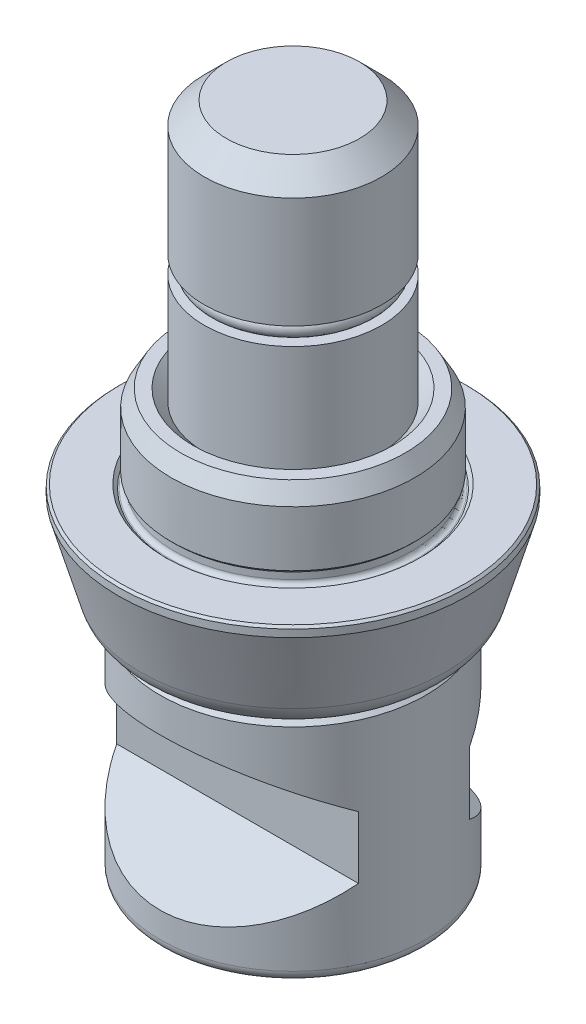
ISO-10303-21;
HEADER;
FILE_DESCRIPTION(('STEP AP214'),'2;1');
FILE_NAME('part.step','',(''),(''),'','','');
FILE_SCHEMA(('AUTOMOTIVE_DESIGN { 1 0 10303 214 1 1 1 1 }'));
ENDSEC;
DATA;
#1=APPLICATION_CONTEXT('core data for automotive mechanical design processes');
#2=APPLICATION_PROTOCOL_DEFINITION('international standard','automotive_design',2000,#1);
#3=PRODUCT_CONTEXT('',#1,'mechanical');
#4=PRODUCT('Part','Part','',(#3));
#5=PRODUCT_RELATED_PRODUCT_CATEGORY('part','',(#4));
#6=PRODUCT_DEFINITION_FORMATION('','',#4);
#7=PRODUCT_DEFINITION_CONTEXT('part definition',#1,'design');
#8=PRODUCT_DEFINITION('design','',#6,#7);
#9=PRODUCT_DEFINITION_SHAPE('','',#8);
#10=(LENGTH_UNIT() NAMED_UNIT(*) SI_UNIT(.MILLI.,.METRE.));
#11=(NAMED_UNIT(*) PLANE_ANGLE_UNIT() SI_UNIT($,.RADIAN.));
#12=(NAMED_UNIT(*) SI_UNIT($,.STERADIAN.) SOLID_ANGLE_UNIT());
#13=UNCERTAINTY_MEASURE_WITH_UNIT(LENGTH_MEASURE(1.E-05),#10,'distance_accuracy_value','');
#14=(GEOMETRIC_REPRESENTATION_CONTEXT(3) GLOBAL_UNCERTAINTY_ASSIGNED_CONTEXT((#13)) GLOBAL_UNIT_ASSIGNED_CONTEXT((#10,
#11,#12)) REPRESENTATION_CONTEXT('',''));
#15=CARTESIAN_POINT('',(0.,0.,0.));
#16=DIRECTION('',(0.,0.,1.));
#17=DIRECTION('',(1.,0.,0.));
#18=AXIS2_PLACEMENT_3D('',#15,#16,#17);
#19=CARTESIAN_POINT('',(-12.,-30.6,15.));
#20=DIRECTION('',(0.,1.,0.));
#21=DIRECTION('',(1.,0.,0.));
#22=AXIS2_PLACEMENT_3D('',#19,#20,#21);
#23=PLANE('',#22);
#24=CARTESIAN_POINT('',(0.,-30.6,0.));
#25=DIRECTION('',(0.,1.,0.));
#26=DIRECTION('',(0.,0.,-1.));
#27=AXIS2_PLACEMENT_3D('',#24,#25,#26);
#28=CIRCLE('',#27,3.75);
#29=CARTESIAN_POINT('',(0.,-30.6,-3.75));
#30=VERTEX_POINT('',#29);
#31=EDGE_CURVE('E1261',#30,#30,#28,.T.);
#32=ORIENTED_EDGE('',*,*,#31,.T.);
#33=EDGE_LOOP('',(#32));
#34=FACE_BOUND('',#33,.T.);
#35=CARTESIAN_POINT('',(0.,-30.6,0.));
#36=DIRECTION('',(0.,1.,0.));
#37=DIRECTION('',(1.,0.,0.));
#38=AXIS2_PLACEMENT_3D('',#35,#36,#37);
#39=CIRCLE('',#38,11.);
#40=CARTESIAN_POINT('',(11.,-30.6,0.));
#41=VERTEX_POINT('',#40);
#42=EDGE_CURVE('E294',#41,#41,#39,.F.);
#43=ORIENTED_EDGE('',*,*,#42,.T.);
#44=EDGE_LOOP('',(#43));
#45=FACE_BOUND('',#44,.T.);
#46=DIRECTION('',(0.982188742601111,0.,-0.18789697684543));
#47=VECTOR('',#46,1.);
#48=CARTESIAN_POINT('',(-2.20369531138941,-30.6,-5.16176807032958));
#49=LINE('',#48,#47);
#50=CARTESIAN_POINT('',(-2.20369531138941,-30.6,-5.16176807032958));
#51=VERTEX_POINT('',#50);
#52=CARTESIAN_POINT('',(-1.73404241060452,-30.6,-5.25161471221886));
#53=VERTEX_POINT('',#52);
#54=EDGE_CURVE('E293',#51,#53,#49,.T.);
#55=ORIENTED_EDGE('',*,*,#54,.T.);
#56=DIRECTION('',(-0.186950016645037,0.,-0.982369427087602));
#57=VECTOR('',#56,1.);
#58=CARTESIAN_POINT('',(-1.73404241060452,-30.6,-5.25161471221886));
#59=LINE('',#58,#57);
#60=CARTESIAN_POINT('',(-1.82062190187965,-30.6,-5.70656543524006));
#61=VERTEX_POINT('',#60);
#62=EDGE_CURVE('E493',#53,#61,#59,.T.);
#63=ORIENTED_EDGE('',*,*,#62,.T.);
#64=CARTESIAN_POINT('',(-1.82062190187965,-30.6,-5.70656543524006));
#65=CARTESIAN_POINT('',(-1.75335664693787,-30.6,-5.72383251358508));
#66=CARTESIAN_POINT('',(-1.62301548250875,-30.6,-5.75729125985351));
#67=CARTESIAN_POINT('',(-1.43840151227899,-30.6,-5.82184016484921));
#68=CARTESIAN_POINT('',(-1.26896664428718,-30.6,-5.89200080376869));
#69=CARTESIAN_POINT('',(-1.11680610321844,-30.6,-5.97242058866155));
#70=CARTESIAN_POINT('',(-0.979933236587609,-30.6,-6.05950206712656));
#71=CARTESIAN_POINT('',(-0.860070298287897,-30.6,-6.15587841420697));
#72=CARTESIAN_POINT('',(-0.754419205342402,-30.6,-6.2588980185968));
#73=CARTESIAN_POINT('',(-0.697642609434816,-30.6,-6.33656639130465));
#74=CARTESIAN_POINT('',(-0.669768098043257,-30.6,-6.37469773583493));
#75=B_SPLINE_CURVE_WITH_KNOTS('',3,(#64,#65,#66,#67,#68,#69,#70,#71,#72,#73,#74),.UNSPECIFIED.,
.F.,.F.,(4,1,1,1,1,1,1,1,4),(0.,0.153100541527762,0.296665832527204,0.430945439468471,
0.557190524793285,0.675784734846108,0.788133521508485,0.895983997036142,1.),.UNSPECIFIED.);
#76=CARTESIAN_POINT('',(-0.669768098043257,-30.6,-6.37469773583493));
#77=VERTEX_POINT('',#76);
#78=EDGE_CURVE('E497',#61,#77,#75,.T.);
#79=ORIENTED_EDGE('',*,*,#78,.T.);
#80=CARTESIAN_POINT('',(-0.669768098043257,-30.6,-6.37469773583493));
#81=CARTESIAN_POINT('',(-0.64205179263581,-30.6,-6.41822425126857));
#82=CARTESIAN_POINT('',(-0.587026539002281,-30.6,-6.5046375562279));
#83=CARTESIAN_POINT('',(-0.523028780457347,-30.6,-6.64412982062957));
#84=CARTESIAN_POINT('',(-0.472246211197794,-30.6,-6.78886529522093));
#85=CARTESIAN_POINT('',(-0.438222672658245,-30.6,-6.94046340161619));
#86=CARTESIAN_POINT('',(-0.419706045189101,-30.6,-7.09811494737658));
#87=CARTESIAN_POINT('',(-0.415699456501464,-30.6,-7.26161023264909));
#88=CARTESIAN_POINT('',(-0.427162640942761,-30.6,-7.43139272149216));
#89=CARTESIAN_POINT('',(-0.446087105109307,-30.6,-7.5455533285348));
#90=CARTESIAN_POINT('',(-0.45576973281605,-30.6,-7.60396315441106));
#91=B_SPLINE_CURVE_WITH_KNOTS('',3,(#80,#81,#82,#83,#84,#85,#86,#87,#88,#89,#90),.UNSPECIFIED.,
.F.,.F.,(4,1,1,1,1,1,1,1,4),(0.,0.120661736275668,0.239550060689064,0.358258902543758,
0.479157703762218,0.602392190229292,0.729252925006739,0.861473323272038,1.),.UNSPECIFIED.);
#92=CARTESIAN_POINT('',(-0.45576973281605,-30.6,-7.60396315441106));
#93=VERTEX_POINT('',#92);
#94=EDGE_CURVE('E549',#77,#93,#91,.T.);
#95=ORIENTED_EDGE('',*,*,#94,.T.);
#96=CARTESIAN_POINT('',(-0.45576973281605,-30.6,-7.60396315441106));
#97=CARTESIAN_POINT('',(-0.468060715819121,-30.6,-7.66195221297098));
#98=CARTESIAN_POINT('',(-0.492105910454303,-30.6,-7.77539783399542));
#99=CARTESIAN_POINT('',(-0.545153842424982,-30.6,-7.93755958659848));
#100=CARTESIAN_POINT('',(-0.60868475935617,-30.6,-8.08861642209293));
#101=CARTESIAN_POINT('',(-0.683968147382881,-30.6,-8.22845687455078));
#102=CARTESIAN_POINT('',(-0.771722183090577,-30.6,-8.3567519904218));
#103=CARTESIAN_POINT('',(-0.872051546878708,-30.6,-8.47300153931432));
#104=CARTESIAN_POINT('',(-0.983246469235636,-30.6,-8.57887604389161));
#105=CARTESIAN_POINT('',(-1.0660056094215,-30.6,-8.6389072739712));
#106=CARTESIAN_POINT('',(-1.10756628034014,-30.6,-8.66905425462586));
#107=B_SPLINE_CURVE_WITH_KNOTS('',3,(#96,#97,#98,#99,#100,#101,#102,#103,#104,#105,#106),
.UNSPECIFIED.,.F.,.F.,(4,1,1,1,1,1,1,1,4),(0.,0.13855916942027,0.271067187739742,
0.398330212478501,0.521420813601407,0.641882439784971,0.76109714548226,0.880025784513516,1.),.UNSPECIFIED.);
#108=CARTESIAN_POINT('',(-1.10756628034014,-30.6,-8.66905425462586));
#109=VERTEX_POINT('',#108);
#110=EDGE_CURVE('E542',#93,#109,#107,.T.);
#111=ORIENTED_EDGE('',*,*,#110,.T.);
#112=CARTESIAN_POINT('',(-1.10756628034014,-30.6,-8.66905425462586));
#113=CARTESIAN_POINT('',(-1.147556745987,-30.6,-8.69407569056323));
#114=CARTESIAN_POINT('',(-1.22915044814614,-30.6,-8.74512764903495));
#115=CARTESIAN_POINT('',(-1.36504052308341,-30.6,-8.80295228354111));
#116=CARTESIAN_POINT('',(-1.51240566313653,-30.6,-8.84782068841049));
#117=CARTESIAN_POINT('',(-1.67156586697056,-30.6,-8.87994722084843));
#118=CARTESIAN_POINT('',(-1.84285703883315,-30.6,-8.89578493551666));
#119=CARTESIAN_POINT('',(-2.0259567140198,-30.6,-8.90086518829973));
#120=CARTESIAN_POINT('',(-2.22116480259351,-30.6,-8.89181990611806));
#121=CARTESIAN_POINT('',(-2.35461815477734,-30.6,-8.8752555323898));
#122=CARTESIAN_POINT('',(-2.4234111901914,-30.6,-8.86671686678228));
#123=B_SPLINE_CURVE_WITH_KNOTS('',3,(#112,#113,#114,#115,#116,#117,#118,#119,#120,#121,#122),
.UNSPECIFIED.,.F.,.F.,(4,1,1,1,1,1,1,1,4),(0.,0.103922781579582,0.212036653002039,
0.324495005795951,0.44333245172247,0.569479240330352,0.703450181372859,0.847133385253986,1.),.UNSPECIFIED.);
#124=CARTESIAN_POINT('',(-2.4234111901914,-30.6,-8.86671686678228));
#125=VERTEX_POINT('',#124);
#126=EDGE_CURVE('E538',#109,#125,#123,.T.);
#127=ORIENTED_EDGE('',*,*,#126,.T.);
#128=DIRECTION('',(-0.187533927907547,0.,-0.982258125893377));
#129=VECTOR('',#128,1.);
#130=CARTESIAN_POINT('',(-2.4234111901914,-30.6,-8.86671686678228));
#131=LINE('',#130,#129);
#132=CARTESIAN_POINT('',(-2.54021182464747,-30.6,-9.47849081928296));
#133=VERTEX_POINT('',#132);
#134=EDGE_CURVE('E536',#125,#133,#131,.T.);
#135=ORIENTED_EDGE('',*,*,#134,.T.);
#136=DIRECTION('',(-0.982188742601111,0.,0.187896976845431));
#137=VECTOR('',#136,1.);
#138=CARTESIAN_POINT('',(-2.54021182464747,-30.6,-9.47849081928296));
#139=LINE('',#138,#137);
#140=CARTESIAN_POINT('',(-3.00986472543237,-30.6,-9.38864417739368));
#141=VERTEX_POINT('',#140);
#142=EDGE_CURVE('E534',#133,#141,#139,.T.);
#143=ORIENTED_EDGE('',*,*,#142,.T.);
#144=DIRECTION('',(0.187533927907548,0.,0.982258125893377));
#145=VECTOR('',#144,1.);
#146=CARTESIAN_POINT('',(-3.00986472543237,-30.6,-9.38864417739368));
#147=LINE('',#146,#145);
#148=CARTESIAN_POINT('',(-2.89306409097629,-30.6,-8.776870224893));
#149=VERTEX_POINT('',#148);
#150=EDGE_CURVE('E529',#141,#149,#147,.T.);
#151=ORIENTED_EDGE('',*,*,#150,.T.);
#152=CARTESIAN_POINT('',(-2.89306409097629,-30.6,-8.776870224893));
#153=CARTESIAN_POINT('',(-2.9583892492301,-30.6,-8.75977334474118));
#154=CARTESIAN_POINT('',(-3.08478903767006,-30.6,-8.72669203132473));
#155=CARTESIAN_POINT('',(-3.26415631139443,-30.6,-8.66443506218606));
#156=CARTESIAN_POINT('',(-3.42767514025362,-30.6,-8.59399365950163));
#157=CARTESIAN_POINT('',(-3.57626051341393,-30.6,-8.51629286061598));
#158=CARTESIAN_POINT('',(-3.70818743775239,-30.6,-8.42858905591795));
#159=CARTESIAN_POINT('',(-3.82475100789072,-30.6,-8.33338131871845));
#160=CARTESIAN_POINT('',(-3.92560069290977,-30.6,-8.229696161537));
#161=CARTESIAN_POINT('',(-3.98081184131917,-30.6,-8.15300778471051));
#162=CARTESIAN_POINT('',(-4.00797923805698,-30.6,-8.11527222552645));
#163=B_SPLINE_CURVE_WITH_KNOTS('',3,(#152,#153,#154,#155,#156,#157,#158,#159,#160,#161,#162),
.UNSPECIFIED.,.F.,.F.,(4,1,1,1,1,1,1,1,4),(0.,0.152672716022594,0.295411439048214,
0.428898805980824,0.555055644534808,0.674088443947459,0.786514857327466,0.894951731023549,1.),.UNSPECIFIED.);
#164=CARTESIAN_POINT('',(-4.00797923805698,-30.6,-8.11527222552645));
#165=VERTEX_POINT('',#164);
#166=EDGE_CURVE('E522',#149,#165,#163,.T.);
#167=ORIENTED_EDGE('',*,*,#166,.T.);
#168=CARTESIAN_POINT('',(-4.00797923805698,-30.6,-8.11527222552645));
#169=CARTESIAN_POINT('',(-4.03568716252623,-30.6,-8.07174297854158));
#170=CARTESIAN_POINT('',(-4.09069577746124,-30.6,-7.98532425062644));
#171=CARTESIAN_POINT('',(-4.15492466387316,-30.6,-7.84563772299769));
#172=CARTESIAN_POINT('',(-4.20520008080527,-30.6,-7.70074342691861));
#173=CARTESIAN_POINT('',(-4.23965910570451,-30.6,-7.54926898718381));
#174=CARTESIAN_POINT('',(-4.25804347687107,-30.6,-7.39157665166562));
#175=CARTESIAN_POINT('',(-4.26205850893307,-30.6,-7.22781685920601));
#176=CARTESIAN_POINT('',(-4.25058676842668,-30.6,-7.05775995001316));
#177=CARTESIAN_POINT('',(-4.23166093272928,-30.6,-6.94359967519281));
#178=CARTESIAN_POINT('',(-4.22197760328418,-30.6,-6.88519001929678));
#179=B_SPLINE_CURVE_WITH_KNOTS('',3,(#168,#169,#170,#171,#172,#173,#174,#175,#176,#177,#178),
.UNSPECIFIED.,.F.,.F.,(4,1,1,1,1,1,1,1,4),(0.,0.120587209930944,0.239402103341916,
0.358639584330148,0.478842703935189,0.602001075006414,0.729420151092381,0.861558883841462,1.),.UNSPECIFIED.);
#180=CARTESIAN_POINT('',(-4.22197760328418,-30.6,-6.88519001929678));
#181=VERTEX_POINT('',#180);
#182=EDGE_CURVE('E515',#165,#181,#179,.T.);
#183=ORIENTED_EDGE('',*,*,#182,.T.);
#184=CARTESIAN_POINT('',(-4.22197760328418,-30.6,-6.88519001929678));
#185=CARTESIAN_POINT('',(-4.20963442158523,-30.6,-6.82721671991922));
#186=CARTESIAN_POINT('',(-4.18555847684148,-30.6,-6.71413712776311));
#187=CARTESIAN_POINT('',(-4.13339606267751,-30.6,-6.55206875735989));
#188=CARTESIAN_POINT('',(-4.07000537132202,-30.6,-6.40113080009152));
#189=CARTESIAN_POINT('',(-3.99368237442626,-30.6,-6.26170269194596));
#190=CARTESIAN_POINT('',(-3.90601736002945,-30.6,-6.13347130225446));
#191=CARTESIAN_POINT('',(-3.80652478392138,-30.6,-6.01673022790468));
#192=CARTESIAN_POINT('',(-3.6951932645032,-30.6,-5.91088182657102));
#193=CARTESIAN_POINT('',(-3.61203162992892,-30.6,-5.85103383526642));
#194=CARTESIAN_POINT('',(-3.5701810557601,-30.6,-5.82091570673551));
#195=B_SPLINE_CURVE_WITH_KNOTS('',3,(#184,#185,#186,#187,#188,#189,#190,#191,#192,#193,#194),
.UNSPECIFIED.,.F.,.F.,(4,1,1,1,1,1,1,1,4),(0.,0.138615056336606,0.270375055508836,
0.397689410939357,0.521134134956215,0.641644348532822,0.760492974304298,0.879469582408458,1.),.UNSPECIFIED.);
#196=CARTESIAN_POINT('',(-3.5701810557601,-30.6,-5.82091570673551));
#197=VERTEX_POINT('',#196);
#198=EDGE_CURVE('E504',#181,#197,#195,.T.);
#199=ORIENTED_EDGE('',*,*,#198,.T.);
#200=CARTESIAN_POINT('',(-3.5701810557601,-30.6,-5.82091570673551));
#201=CARTESIAN_POINT('',(-3.53103657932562,-30.6,-5.79559123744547));
#202=CARTESIAN_POINT('',(-3.45172536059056,-30.6,-5.74428094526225));
#203=CARTESIAN_POINT('',(-3.31916986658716,-30.6,-5.68646319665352));
#204=CARTESIAN_POINT('',(-3.17620983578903,-30.6,-5.64002338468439));
#205=CARTESIAN_POINT('',(-3.02097411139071,-30.6,-5.60935342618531));
#206=CARTESIAN_POINT('',(-2.85470879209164,-30.6,-5.58906853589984));
#207=CARTESIAN_POINT('',(-2.67654458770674,-30.6,-5.58548002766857));
#208=CARTESIAN_POINT('',(-2.48687535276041,-30.6,-5.5932884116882));
#209=CARTESIAN_POINT('',(-2.35717448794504,-30.6,-5.60874584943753));
#210=CARTESIAN_POINT('',(-2.29027480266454,-30.6,-5.61671879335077));
#211=B_SPLINE_CURVE_WITH_KNOTS('',3,(#200,#201,#202,#203,#204,#205,#206,#207,#208,#209,#210),
.UNSPECIFIED.,.F.,.F.,(4,1,1,1,1,1,1,1,4),(0.,0.10533404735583,0.213418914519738,
0.326022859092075,0.444905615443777,0.570830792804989,0.704560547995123,0.847612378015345,1.),.UNSPECIFIED.);
#212=CARTESIAN_POINT('',(-2.29027480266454,-30.6,-5.61671879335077));
#213=VERTEX_POINT('',#212);
#214=EDGE_CURVE('E503',#197,#213,#211,.T.);
#215=ORIENTED_EDGE('',*,*,#214,.T.);
#216=DIRECTION('',(0.186950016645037,0.,0.982369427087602));
#217=VECTOR('',#216,1.);
#218=CARTESIAN_POINT('',(-2.29027480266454,-30.6,-5.61671879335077));
#219=LINE('',#218,#217);
#220=EDGE_CURVE('E502',#213,#51,#219,.T.);
#221=ORIENTED_EDGE('',*,*,#220,.T.);
#222=EDGE_LOOP('',(#55,#63,#79,#95,#111,#127,#135,#143,#151,#167,#183,#199,#215,#221));
#223=FACE_BOUND('',#222,.T.);
#224=CARTESIAN_POINT('',(0.809820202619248,-30.6,-6.56377433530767));
#225=CARTESIAN_POINT('',(0.792272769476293,-30.6,-6.58674517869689));
#226=CARTESIAN_POINT('',(0.756509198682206,-30.6,-6.6335622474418));
#227=CARTESIAN_POINT('',(0.714621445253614,-30.6,-6.71344242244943));
#228=CARTESIAN_POINT('',(0.681168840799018,-30.6,-6.80132306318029));
#229=CARTESIAN_POINT('',(0.654643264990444,-30.6,-6.89663348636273));
#230=CARTESIAN_POINT('',(0.639303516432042,-30.6,-7.00086239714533));
#231=CARTESIAN_POINT('',(0.629987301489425,-30.6,-7.11272478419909));
#232=CARTESIAN_POINT('',(0.630355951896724,-30.6,-7.23316577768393));
#233=CARTESIAN_POINT('',(0.636666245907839,-30.6,-7.31579388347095));
#234=CARTESIAN_POINT('',(0.639928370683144,-30.6,-7.35850872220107));
#235=B_SPLINE_CURVE_WITH_KNOTS('',3,(#224,#225,#226,#227,#228,#229,#230,#231,#232,#233,#234),
.UNSPECIFIED.,.F.,.F.,(4,1,1,1,1,1,1,1,4),(0.,0.10390292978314,0.211765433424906,
0.323150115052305,0.442026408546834,0.567057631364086,0.701755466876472,0.845821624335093,1.),.UNSPECIFIED.);
#236=CARTESIAN_POINT('',(0.809820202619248,-30.6,-6.56377433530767));
#237=VERTEX_POINT('',#236);
#238=CARTESIAN_POINT('',(0.639928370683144,-30.6,-7.35850872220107));
#239=VERTEX_POINT('',#238);
#240=EDGE_CURVE('E622',#237,#239,#235,.T.);
#241=ORIENTED_EDGE('',*,*,#240,.T.);
#242=DIRECTION('',(-0.995517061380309,0.,-0.0945821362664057));
#243=VECTOR('',#242,1.);
#244=CARTESIAN_POINT('',(0.639928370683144,-30.6,-7.35850872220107));
#245=LINE('',#244,#243);
#246=CARTESIAN_POINT('',(0.132703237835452,-30.6,-7.40669919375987));
#247=VERTEX_POINT('',#246);
#248=EDGE_CURVE('E733',#239,#247,#245,.T.);
#249=ORIENTED_EDGE('',*,*,#248,.T.);
#250=CARTESIAN_POINT('',(0.132703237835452,-30.6,-7.40669919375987));
#251=CARTESIAN_POINT('',(0.128650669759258,-30.6,-7.35119343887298));
#252=CARTESIAN_POINT('',(0.120790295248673,-30.6,-7.24353429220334));
#253=CARTESIAN_POINT('',(0.122254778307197,-30.6,-7.0859065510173));
#254=CARTESIAN_POINT('',(0.136110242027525,-30.6,-6.93786435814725));
#255=CARTESIAN_POINT('',(0.160687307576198,-30.6,-6.7986100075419));
#256=CARTESIAN_POINT('',(0.199587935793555,-30.6,-6.6690540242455));
#257=CARTESIAN_POINT('',(0.249131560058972,-30.6,-6.54822732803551));
#258=CARTESIAN_POINT('',(0.311291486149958,-30.6,-6.43668122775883));
#259=CARTESIAN_POINT('',(0.362218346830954,-30.6,-6.36990892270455));
#260=CARTESIAN_POINT('',(0.387540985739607,-30.6,-6.33670736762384));
#261=B_SPLINE_CURVE_WITH_KNOTS('',3,(#250,#251,#252,#253,#254,#255,#256,#257,#258,#259,#260),
.UNSPECIFIED.,.F.,.F.,(4,1,1,1,1,1,1,1,4),(0.,0.147854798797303,0.286779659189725,
0.418314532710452,0.542630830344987,0.66189884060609,0.777051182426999,0.889141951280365,1.),.UNSPECIFIED.);
#262=CARTESIAN_POINT('',(0.387540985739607,-30.6,-6.33670736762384));
#263=VERTEX_POINT('',#262);
#264=EDGE_CURVE('E726',#247,#263,#261,.T.);
#265=ORIENTED_EDGE('',*,*,#264,.T.);
#266=CARTESIAN_POINT('',(0.387540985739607,-30.6,-6.33670736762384));
#267=CARTESIAN_POINT('',(0.409396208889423,-30.6,-6.31148926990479));
#268=CARTESIAN_POINT('',(0.452338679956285,-30.6,-6.26193921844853));
#269=CARTESIAN_POINT('',(0.524010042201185,-30.6,-6.19613485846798));
#270=CARTESIAN_POINT('',(0.60039965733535,-30.6,-6.13966281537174));
#271=CARTESIAN_POINT('',(0.68078927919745,-30.6,-6.09121351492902));
#272=CARTESIAN_POINT('',(0.765175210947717,-30.6,-6.0508554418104));
#273=CARTESIAN_POINT('',(0.854152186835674,-30.6,-6.01964230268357));
#274=CARTESIAN_POINT('',(0.947572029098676,-30.6,-5.99747800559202));
#275=CARTESIAN_POINT('',(1.01174093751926,-30.6,-5.98951925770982));
#276=CARTESIAN_POINT('',(1.04423825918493,-30.6,-5.98548867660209));
#277=B_SPLINE_CURVE_WITH_KNOTS('',3,(#266,#267,#268,#269,#270,#271,#272,#273,#274,#275,#276),
.UNSPECIFIED.,.F.,.F.,(4,1,1,1,1,1,1,1,4),(0.,0.130760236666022,0.256925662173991,
0.380540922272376,0.50264904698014,0.624406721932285,0.746622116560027,0.871680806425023,1.),.UNSPECIFIED.);
#278=CARTESIAN_POINT('',(1.04423825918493,-30.6,-5.98548867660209));
#279=VERTEX_POINT('',#278);
#280=EDGE_CURVE('E719',#263,#279,#277,.T.);
#281=ORIENTED_EDGE('',*,*,#280,.T.);
#282=CARTESIAN_POINT('',(1.04423825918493,-30.6,-5.98548867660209));
#283=CARTESIAN_POINT('',(1.08369278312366,-30.6,-5.98268972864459));
#284=CARTESIAN_POINT('',(1.16092059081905,-30.6,-5.9772111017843));
#285=CARTESIAN_POINT('',(1.27463901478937,-30.6,-5.97964319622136));
#286=CARTESIAN_POINT('',(1.38296281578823,-30.6,-5.99167628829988));
#287=CARTESIAN_POINT('',(1.48591107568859,-30.6,-6.01373262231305));
#288=CARTESIAN_POINT('',(1.58347529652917,-30.6,-6.04590076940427));
#289=CARTESIAN_POINT('',(1.67626174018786,-30.6,-6.08660772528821));
#290=CARTESIAN_POINT('',(1.76349746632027,-30.6,-6.1372753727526));
#291=CARTESIAN_POINT('',(1.81652225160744,-30.6,-6.17819400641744));
#292=CARTESIAN_POINT('',(1.84305658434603,-30.6,-6.19867025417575));
#293=B_SPLINE_CURVE_WITH_KNOTS('',3,(#282,#283,#284,#285,#286,#287,#288,#289,#290,#291,#292),
.UNSPECIFIED.,.F.,.F.,(4,1,1,1,1,1,1,1,4),(0.,0.139690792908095,0.273429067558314,
0.401219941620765,0.524233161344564,0.64469251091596,0.763555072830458,0.881679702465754,1.),.UNSPECIFIED.);
#294=CARTESIAN_POINT('',(1.84305658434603,-30.6,-6.19867025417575));
#295=VERTEX_POINT('',#294);
#296=EDGE_CURVE('E712',#279,#295,#293,.T.);
#297=ORIENTED_EDGE('',*,*,#296,.T.);
#298=CARTESIAN_POINT('',(1.84305658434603,-30.6,-6.19867025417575));
#299=CARTESIAN_POINT('',(1.86828799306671,-30.6,-6.22079276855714));
#300=CARTESIAN_POINT('',(1.91788262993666,-30.6,-6.26427658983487));
#301=CARTESIAN_POINT('',(1.98379791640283,-30.6,-6.33714960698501));
#302=CARTESIAN_POINT('',(2.04122871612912,-30.6,-6.41472243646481));
#303=CARTESIAN_POINT('',(2.08956648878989,-30.6,-6.49789438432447));
#304=CARTESIAN_POINT('',(2.12975921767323,-30.6,-6.58571618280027));
#305=CARTESIAN_POINT('',(2.16172609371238,-30.6,-6.67836468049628));
#306=CARTESIAN_POINT('',(2.18501380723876,-30.6,-6.77604683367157));
#307=CARTESIAN_POINT('',(2.1927810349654,-30.6,-6.84327753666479));
#308=CARTESIAN_POINT('',(2.19672563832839,-30.6,-6.87742079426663));
#309=B_SPLINE_CURVE_WITH_KNOTS('',3,(#298,#299,#300,#301,#302,#303,#304,#305,#306,#307,#308),
.UNSPECIFIED.,.F.,.F.,(4,1,1,1,1,1,1,1,4),(0.,0.127939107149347,0.251475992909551,
0.374052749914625,0.495555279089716,0.617801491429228,0.741974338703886,0.868961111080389,1.),.UNSPECIFIED.);
#310=CARTESIAN_POINT('',(2.19672563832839,-30.6,-6.87742079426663));
#311=VERTEX_POINT('',#310);
#312=EDGE_CURVE('E705',#295,#311,#309,.T.);
#313=ORIENTED_EDGE('',*,*,#312,.T.);
#314=CARTESIAN_POINT('',(2.19672563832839,-30.6,-6.87742079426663));
#315=CARTESIAN_POINT('',(2.200036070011,-30.6,-6.92096178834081));
#316=CARTESIAN_POINT('',(2.20657073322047,-30.6,-7.00691001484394));
#317=CARTESIAN_POINT('',(2.20133898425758,-30.6,-7.13504961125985));
#318=CARTESIAN_POINT('',(2.18844566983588,-30.6,-7.26009980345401));
#319=CARTESIAN_POINT('',(2.1623779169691,-30.6,-7.38188314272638));
#320=CARTESIAN_POINT('',(2.12679903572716,-30.6,-7.50040148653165));
#321=CARTESIAN_POINT('',(2.07944804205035,-30.6,-7.6154847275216));
#322=CARTESIAN_POINT('',(2.02270462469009,-30.6,-7.72792181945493));
#323=CARTESIAN_POINT('',(1.97659495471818,-30.6,-7.79888171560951));
#324=CARTESIAN_POINT('',(1.95332291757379,-30.6,-7.83469592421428));
#325=B_SPLINE_CURVE_WITH_KNOTS('',3,(#314,#315,#316,#317,#318,#319,#320,#321,#322,#323,#324),
.UNSPECIFIED.,.F.,.F.,(4,1,1,1,1,1,1,1,4),(0.,0.12978098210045,0.256182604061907,
0.380852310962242,0.503311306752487,0.626027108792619,0.748443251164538,0.87303665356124,1.),.UNSPECIFIED.);
#326=CARTESIAN_POINT('',(1.95332291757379,-30.6,-7.83469592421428));
#327=VERTEX_POINT('',#326);
#328=EDGE_CURVE('E698',#311,#327,#325,.T.);
#329=ORIENTED_EDGE('',*,*,#328,.T.);
#330=CARTESIAN_POINT('',(1.95332291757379,-30.6,-7.83469592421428));
#331=CARTESIAN_POINT('',(1.86130228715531,-30.6,-7.9686241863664));
#332=CARTESIAN_POINT('',(1.67752758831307,-30.6,-8.23609275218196));
#333=CARTESIAN_POINT('',(1.4806729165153,-30.6,-8.49408632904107));
#334=CARTESIAN_POINT('',(1.38238834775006,-30.6,-8.62289600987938));
#335=B_SPLINE_CURVE_WITH_KNOTS('',3,(#330,#331,#332,#333,#334),.UNSPECIFIED.,.F.,.F.,(4,1,4),
(0.,0.50072524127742,1.),.UNSPECIFIED.);
#336=CARTESIAN_POINT('',(1.38238834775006,-30.6,-8.62289600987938));
#337=VERTEX_POINT('',#336);
#338=EDGE_CURVE('E691',#327,#337,#335,.T.);
#339=ORIENTED_EDGE('',*,*,#338,.T.);
#340=CARTESIAN_POINT('',(1.38238834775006,-30.6,-8.62289600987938));
#341=CARTESIAN_POINT('',(1.32987420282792,-30.6,-8.69479714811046));
#342=CARTESIAN_POINT('',(1.22497546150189,-30.6,-8.83842204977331));
#343=CARTESIAN_POINT('',(1.11968735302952,-30.6,-8.98176175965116));
#344=CARTESIAN_POINT('',(1.06710831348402,-30.6,-9.0533431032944));
#345=B_SPLINE_CURVE_WITH_KNOTS('',3,(#340,#341,#342,#343,#344),.UNSPECIFIED.,.F.,.F.,(4,1,4),
(0.,0.500617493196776,1.),.UNSPECIFIED.);
#346=CARTESIAN_POINT('',(1.06710831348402,-30.6,-9.0533431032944));
#347=VERTEX_POINT('',#346);
#348=EDGE_CURVE('E684',#337,#347,#345,.T.);
#349=ORIENTED_EDGE('',*,*,#348,.T.);
#350=CARTESIAN_POINT('',(1.06710831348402,-30.6,-9.0533431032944));
#351=CARTESIAN_POINT('',(1.0235808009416,-30.6,-9.11597149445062));
#352=CARTESIAN_POINT('',(0.939112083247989,-30.6,-9.23750703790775));
#353=CARTESIAN_POINT('',(0.869633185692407,-30.6,-9.36817987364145));
#354=CARTESIAN_POINT('',(0.835957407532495,-30.6,-9.43151578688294));
#355=B_SPLINE_CURVE_WITH_KNOTS('',3,(#350,#351,#352,#353,#354),.UNSPECIFIED.,.F.,.F.,(4,1,4),
(0.,0.515309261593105,1.),.UNSPECIFIED.);
#356=CARTESIAN_POINT('',(0.835957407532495,-30.6,-9.43151578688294));
#357=VERTEX_POINT('',#356);
#358=EDGE_CURVE('E680',#347,#357,#355,.T.);
#359=ORIENTED_EDGE('',*,*,#358,.T.);
#360=DIRECTION('',(0.995535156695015,0.,0.0943914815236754));
#361=VECTOR('',#360,1.);
#362=CARTESIAN_POINT('',(0.835957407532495,-30.6,-9.43151578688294));
#363=LINE('',#362,#361);
#364=CARTESIAN_POINT('',(2.48995240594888,-30.6,-9.27469255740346));
#365=VERTEX_POINT('',#364);
#366=EDGE_CURVE('E678',#357,#365,#363,.T.);
#367=ORIENTED_EDGE('',*,*,#366,.T.);
#368=DIRECTION('',(0.0935217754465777,0.,-0.995617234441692));
#369=VECTOR('',#368,1.);
#370=CARTESIAN_POINT('',(2.48995240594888,-30.6,-9.27469255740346));
#371=LINE('',#370,#369);
#372=CARTESIAN_POINT('',(2.52915821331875,-30.6,-9.69207104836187));
#373=VERTEX_POINT('',#372);
#374=EDGE_CURVE('E676',#365,#373,#371,.T.);
#375=ORIENTED_EDGE('',*,*,#374,.T.);
#376=DIRECTION('',(-0.995539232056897,0.,-0.0943484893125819));
#377=VECTOR('',#376,1.);
#378=CARTESIAN_POINT('',(2.52915821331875,-30.6,-9.69207104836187));
#379=LINE('',#378,#377);
#380=CARTESIAN_POINT('',(0.279725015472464,-30.6,-9.90525262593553));
#381=VERTEX_POINT('',#380);
#382=EDGE_CURVE('E674',#373,#381,#379,.T.);
#383=ORIENTED_EDGE('',*,*,#382,.T.);
#384=DIRECTION('',(-0.0936781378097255,0.,0.995602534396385));
#385=VECTOR('',#384,1.);
#386=CARTESIAN_POINT('',(0.279725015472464,-30.6,-9.90525262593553));
#387=LINE('',#386,#385);
#388=CARTESIAN_POINT('',(0.24460314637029,-30.6,-9.53198066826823));
#389=VERTEX_POINT('',#388);
#390=EDGE_CURVE('E669',#381,#389,#387,.T.);
#391=ORIENTED_EDGE('',*,*,#390,.T.);
#392=CARTESIAN_POINT('',(0.24460314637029,-30.6,-9.53198066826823));
#393=CARTESIAN_POINT('',(0.247370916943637,-30.6,-9.51200040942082));
#394=CARTESIAN_POINT('',(0.253252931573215,-30.6,-9.4695387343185));
#395=CARTESIAN_POINT('',(0.273462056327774,-30.6,-9.40396920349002));
#396=CARTESIAN_POINT('',(0.300465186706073,-30.6,-9.33197727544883));
#397=CARTESIAN_POINT('',(0.336019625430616,-30.6,-9.25359287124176));
#398=CARTESIAN_POINT('',(0.379352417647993,-30.6,-9.16840677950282));
#399=CARTESIAN_POINT('',(0.432119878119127,-30.6,-9.07726534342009));
#400=CARTESIAN_POINT('',(0.492188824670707,-30.6,-8.97903538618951));
#401=CARTESIAN_POINT('',(0.537257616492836,-30.6,-8.91293328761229));
#402=CARTESIAN_POINT('',(0.560699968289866,-30.6,-8.87855054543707));
#403=B_SPLINE_CURVE_WITH_KNOTS('',3,(#392,#393,#394,#395,#396,#397,#398,#399,#400,#401,#402),
.UNSPECIFIED.,.F.,.F.,(4,1,1,1,1,1,1,1,4),(0.,0.0825740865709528,0.175484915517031,
0.280387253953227,0.397797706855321,0.528084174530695,0.672066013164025,0.829426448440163,1.),.UNSPECIFIED.);
#404=CARTESIAN_POINT('',(0.560699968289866,-30.6,-8.87855054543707));
#405=VERTEX_POINT('',#404);
#406=EDGE_CURVE('E662',#389,#405,#403,.T.);
#407=ORIENTED_EDGE('',*,*,#406,.T.);
#408=CARTESIAN_POINT('',(0.560699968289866,-30.6,-8.87855054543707));
#409=CARTESIAN_POINT('',(0.60091063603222,-30.6,-8.82566741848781));
#410=CARTESIAN_POINT('',(0.67955325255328,-30.6,-8.72224044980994));
#411=CARTESIAN_POINT('',(0.796328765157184,-30.6,-8.57160716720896));
#412=CARTESIAN_POINT('',(0.904978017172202,-30.6,-8.42574278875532));
#413=CARTESIAN_POINT('',(1.00980247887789,-30.6,-8.28832541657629));
#414=CARTESIAN_POINT('',(1.10814012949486,-30.6,-8.15692590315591));
#415=CARTESIAN_POINT('',(1.2008278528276,-30.6,-8.03238755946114));
#416=CARTESIAN_POINT('',(1.28852329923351,-30.6,-7.9147184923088));
#417=CARTESIAN_POINT('',(1.34458977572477,-30.6,-7.83826926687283));
#418=CARTESIAN_POINT('',(1.37177010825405,-30.6,-7.80120763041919));
#419=B_SPLINE_CURVE_WITH_KNOTS('',3,(#408,#409,#410,#411,#412,#413,#414,#415,#416,#417,#418),
.UNSPECIFIED.,.F.,.F.,(4,1,1,1,1,1,1,1,4),(0.,0.147790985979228,0.28904443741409,
0.423990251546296,0.552395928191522,0.673532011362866,0.789096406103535,0.897756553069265,1.),.UNSPECIFIED.);
#420=CARTESIAN_POINT('',(1.37177010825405,-30.6,-7.80120763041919));
#421=VERTEX_POINT('',#420);
#422=EDGE_CURVE('E655',#405,#421,#419,.T.);
#423=ORIENTED_EDGE('',*,*,#422,.T.);
#424=CARTESIAN_POINT('',(1.37177010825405,-30.6,-7.80120763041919));
#425=CARTESIAN_POINT('',(1.39852497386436,-30.6,-7.76542229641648));
#426=CARTESIAN_POINT('',(1.45068033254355,-30.6,-7.69566313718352));
#427=CARTESIAN_POINT('',(1.51680580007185,-30.6,-7.58630251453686));
#428=CARTESIAN_POINT('',(1.57197815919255,-30.6,-7.47745758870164));
#429=CARTESIAN_POINT('',(1.61591842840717,-30.6,-7.368345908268));
#430=CARTESIAN_POINT('',(1.6473209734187,-30.6,-7.25829896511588));
#431=CARTESIAN_POINT('',(1.66577179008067,-30.6,-7.14790046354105));
#432=CARTESIAN_POINT('',(1.67398149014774,-30.6,-7.0372837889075));
#433=CARTESIAN_POINT('',(1.66962958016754,-30.6,-6.96399618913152));
#434=CARTESIAN_POINT('',(1.66744723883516,-30.6,-6.9272448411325));
#435=B_SPLINE_CURVE_WITH_KNOTS('',3,(#424,#425,#426,#427,#428,#429,#430,#431,#432,#433,#434),
.UNSPECIFIED.,.F.,.F.,(4,1,1,1,1,1,1,1,4),(0.,0.141712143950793,0.276250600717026,
0.404913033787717,0.528606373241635,0.648941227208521,0.767255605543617,0.883286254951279,1.),.UNSPECIFIED.);
#436=CARTESIAN_POINT('',(1.66744723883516,-30.6,-6.9272448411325));
#437=VERTEX_POINT('',#436);
#438=EDGE_CURVE('E648',#421,#437,#435,.T.);
#439=ORIENTED_EDGE('',*,*,#438,.T.);
#440=CARTESIAN_POINT('',(1.66744723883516,-30.6,-6.9272448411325));
#441=CARTESIAN_POINT('',(1.66481485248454,-30.6,-6.90568032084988));
#442=CARTESIAN_POINT('',(1.65964445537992,-30.6,-6.86332440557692));
#443=CARTESIAN_POINT('',(1.64579807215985,-30.6,-6.80166028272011));
#444=CARTESIAN_POINT('',(1.62594637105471,-30.6,-6.74353818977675));
#445=CARTESIAN_POINT('',(1.60154034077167,-30.6,-6.68831344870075));
#446=CARTESIAN_POINT('',(1.57130739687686,-30.6,-6.63684173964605));
#447=CARTESIAN_POINT('',(1.53544600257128,-30.6,-6.5891596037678));
#448=CARTESIAN_POINT('',(1.49568810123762,-30.6,-6.54358382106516));
#449=CARTESIAN_POINT('',(1.46494875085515,-30.6,-6.51687335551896));
#450=CARTESIAN_POINT('',(1.44936493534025,-30.6,-6.50333204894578));
#451=B_SPLINE_CURVE_WITH_KNOTS('',3,(#440,#441,#442,#443,#444,#445,#446,#447,#448,#449,#450),
.UNSPECIFIED.,.F.,.F.,(4,1,1,1,1,1,1,1,4),(0.,0.13300602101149,0.261243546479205,
0.386219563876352,0.508632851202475,0.630465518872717,0.750863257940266,0.873696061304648,1.),.UNSPECIFIED.);
#452=CARTESIAN_POINT('',(1.44936493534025,-30.6,-6.50333204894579));
#453=VERTEX_POINT('',#452);
#454=EDGE_CURVE('E641',#437,#453,#451,.T.);
#455=ORIENTED_EDGE('',*,*,#454,.T.);
#456=CARTESIAN_POINT('',(1.44936493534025,-30.6,-6.50333204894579));
#457=CARTESIAN_POINT('',(1.42475102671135,-30.6,-6.48495362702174));
#458=CARTESIAN_POINT('',(1.37625185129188,-30.6,-6.44874083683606));
#459=CARTESIAN_POINT('',(1.29082145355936,-30.6,-6.41570838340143));
#460=CARTESIAN_POINT('',(1.19993329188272,-30.6,-6.3971881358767));
#461=CARTESIAN_POINT('',(1.13743249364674,-30.6,-6.40040612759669));
#462=CARTESIAN_POINT('',(1.10549733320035,-30.6,-6.40205037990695));
#463=B_SPLINE_CURVE_WITH_KNOTS('',3,(#456,#457,#458,#459,#460,#461,#462),.UNSPECIFIED.,.F.,.F.,
(4,1,1,1,4),(0.,0.249441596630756,0.491499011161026,0.740178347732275,1.),.UNSPECIFIED.);
#464=CARTESIAN_POINT('',(1.10549733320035,-30.6,-6.40205037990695));
#465=VERTEX_POINT('',#464);
#466=EDGE_CURVE('E634',#453,#465,#463,.T.);
#467=ORIENTED_EDGE('',*,*,#466,.T.);
#468=CARTESIAN_POINT('',(1.10549733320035,-30.6,-6.40205037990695));
#469=CARTESIAN_POINT('',(1.07684726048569,-30.6,-6.40623051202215));
#470=CARTESIAN_POINT('',(1.02031215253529,-30.6,-6.4144791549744));
#471=CARTESIAN_POINT('',(0.941425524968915,-30.6,-6.44899833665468));
#472=CARTESIAN_POINT('',(0.869023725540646,-30.6,-6.49760240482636));
#473=CARTESIAN_POINT('',(0.8299206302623,-30.6,-6.54130803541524));
#474=CARTESIAN_POINT('',(0.809820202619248,-30.6,-6.56377433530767));
#475=B_SPLINE_CURVE_WITH_KNOTS('',3,(#468,#469,#470,#471,#472,#473,#474),.UNSPECIFIED.,.F.,.F.,
(4,1,1,1,4),(0.,0.25001689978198,0.49335764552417,0.739567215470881,1.),.UNSPECIFIED.);
#476=EDGE_CURVE('E627',#465,#237,#475,.T.);
#477=ORIENTED_EDGE('',*,*,#476,.T.);
#478=EDGE_LOOP('',(#241,#249,#265,#281,#297,#313,#329,#339,#349,#359,#367,#375,#383,#391,#407,
#423,#439,#455,#467,#477));
#479=FACE_BOUND('',#478,.T.);
#480=CARTESIAN_POINT('',(2.95753036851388,-30.6,-6.21395586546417));
#481=CARTESIAN_POINT('',(2.94446193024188,-30.6,-6.23975688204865));
#482=CARTESIAN_POINT('',(2.91798138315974,-30.6,-6.29203742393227));
#483=CARTESIAN_POINT('',(2.89277428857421,-30.6,-6.37864400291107));
#484=CARTESIAN_POINT('',(2.87554642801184,-30.6,-6.47081381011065));
#485=CARTESIAN_POINT('',(2.8681501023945,-30.6,-6.56971728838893));
#486=CARTESIAN_POINT('',(2.8723790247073,-30.6,-6.67464937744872));
#487=CARTESIAN_POINT('',(2.88433222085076,-30.6,-6.78617087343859));
#488=CARTESIAN_POINT('',(2.90784648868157,-30.6,-6.90391786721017));
#489=CARTESIAN_POINT('',(2.92929325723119,-30.6,-6.98376020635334));
#490=CARTESIAN_POINT('',(2.94037782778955,-30.6,-7.02502600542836));
#491=B_SPLINE_CURVE_WITH_KNOTS('',3,(#480,#481,#482,#483,#484,#485,#486,#487,#488,#489,#490),
.UNSPECIFIED.,.F.,.F.,(4,1,1,1,1,1,1,1,4),(0.,0.104086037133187,0.210909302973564,
0.323743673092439,0.44188158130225,0.567603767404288,0.701928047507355,0.845944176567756,1.),.UNSPECIFIED.);
#492=CARTESIAN_POINT('',(2.95753036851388,-30.6,-6.21395586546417));
#493=VERTEX_POINT('',#492);
#494=CARTESIAN_POINT('',(2.94037782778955,-30.6,-7.02502600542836));
#495=VERTEX_POINT('',#494);
#496=EDGE_CURVE('E738',#493,#495,#491,.T.);
#497=ORIENTED_EDGE('',*,*,#496,.T.);
#498=DIRECTION('',(-0.960179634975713,0.,-0.279383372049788));
#499=VECTOR('',#498,1.);
#500=CARTESIAN_POINT('',(2.94037782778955,-30.6,-7.02502600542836));
#501=LINE('',#500,#499);
#502=CARTESIAN_POINT('',(2.45193881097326,-30.6,-7.16714705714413));
#503=VERTEX_POINT('',#502);
#504=EDGE_CURVE('E31',#495,#503,#501,.T.);
#505=ORIENTED_EDGE('',*,*,#504,.T.);
#506=CARTESIAN_POINT('',(2.45193881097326,-30.6,-7.16714705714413));
#507=CARTESIAN_POINT('',(2.43754898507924,-30.6,-7.11369662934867));
#508=CARTESIAN_POINT('',(2.40956316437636,-30.6,-7.00974442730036));
#509=CARTESIAN_POINT('',(2.38157284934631,-30.6,-6.85491311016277));
#510=CARTESIAN_POINT('',(2.36756069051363,-30.6,-6.70680779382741));
#511=CARTESIAN_POINT('',(2.36609753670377,-30.6,-6.56569227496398));
#512=CARTESIAN_POINT('',(2.37904303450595,-30.6,-6.43117301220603));
#513=CARTESIAN_POINT('',(2.40617163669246,-30.6,-6.30363649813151));
#514=CARTESIAN_POINT('',(2.44549337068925,-30.6,-6.18227151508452));
#515=CARTESIAN_POINT('',(2.48310461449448,-30.6,-6.10736231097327));
#516=CARTESIAN_POINT('',(2.50176285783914,-30.6,-6.07020123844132));
#517=B_SPLINE_CURVE_WITH_KNOTS('',3,(#506,#507,#508,#509,#510,#511,#512,#513,#514,#515,#516),
.UNSPECIFIED.,.F.,.F.,(4,1,1,1,1,1,1,1,4),(0.,0.147300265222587,0.286474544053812,
0.418229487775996,0.542886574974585,0.661586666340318,0.777147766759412,0.889447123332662,1.),.UNSPECIFIED.);
#518=CARTESIAN_POINT('',(2.50176285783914,-30.6,-6.07020123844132));
#519=VERTEX_POINT('',#518);
#520=EDGE_CURVE('E35',#503,#519,#517,.T.);
#521=ORIENTED_EDGE('',*,*,#520,.T.);
#522=CARTESIAN_POINT('',(2.50176285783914,-30.6,-6.07020123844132));
#523=CARTESIAN_POINT('',(2.51831614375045,-30.6,-6.04149356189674));
#524=CARTESIAN_POINT('',(2.55101520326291,-30.6,-5.98478494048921));
#525=CARTESIAN_POINT('',(2.60981549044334,-30.6,-5.90762361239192));
#526=CARTESIAN_POINT('',(2.67242180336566,-30.6,-5.83629704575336));
#527=CARTESIAN_POINT('',(2.74261513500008,-30.6,-5.77428098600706));
#528=CARTESIAN_POINT('',(2.81780156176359,-30.6,-5.71906306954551));
#529=CARTESIAN_POINT('',(2.8995901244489,-30.6,-5.67234491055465));
#530=CARTESIAN_POINT('',(2.98689290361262,-30.6,-5.6329694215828));
#531=CARTESIAN_POINT('',(3.04825625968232,-30.6,-5.61305251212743));
#532=CARTESIAN_POINT('',(3.07923172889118,-30.6,-5.60299870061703));
#533=B_SPLINE_CURVE_WITH_KNOTS('',3,(#522,#523,#524,#525,#526,#527,#528,#529,#530,#531,#532),
.UNSPECIFIED.,.F.,.F.,(4,1,1,1,1,1,1,1,4),(0.,0.130114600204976,0.257026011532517,
0.380549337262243,0.502561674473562,0.624348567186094,0.746590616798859,0.872082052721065,1.),.UNSPECIFIED.);
#534=CARTESIAN_POINT('',(3.07923172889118,-30.6,-5.60299870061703));
#535=VERTEX_POINT('',#534);
#536=EDGE_CURVE('E834',#519,#535,#533,.T.);
#537=ORIENTED_EDGE('',*,*,#536,.T.);
#538=CARTESIAN_POINT('',(3.07923172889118,-30.6,-5.60299870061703));
#539=CARTESIAN_POINT('',(3.11748084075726,-30.6,-5.59285658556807));
#540=CARTESIAN_POINT('',(3.19230412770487,-30.6,-5.57301648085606));
#541=CARTESIAN_POINT('',(3.30433433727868,-30.6,-5.55424905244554));
#542=CARTESIAN_POINT('',(3.4128825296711,-30.6,-5.54563679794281));
#543=CARTESIAN_POINT('',(3.51791686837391,-30.6,-5.5482863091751));
#544=CARTESIAN_POINT('',(3.61983510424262,-30.6,-5.56015743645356));
#545=CARTESIAN_POINT('',(3.71835961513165,-30.6,-5.58337499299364));
#546=CARTESIAN_POINT('',(3.81379334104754,-30.6,-5.61634851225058));
#547=CARTESIAN_POINT('',(3.87347867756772,-30.6,-5.64718205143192));
#548=CARTESIAN_POINT('',(3.90337047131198,-30.6,-5.66262419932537));
#549=B_SPLINE_CURVE_WITH_KNOTS('',3,(#538,#539,#540,#541,#542,#543,#544,#545,#546,#547,#548),
.UNSPECIFIED.,.F.,.F.,(4,1,1,1,1,1,1,1,4),(0.,0.139797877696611,0.273473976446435,
0.400857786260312,0.524062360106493,0.644253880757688,0.762828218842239,0.881218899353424,1.),.UNSPECIFIED.);
#550=CARTESIAN_POINT('',(3.90337047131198,-30.6,-5.66262419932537));
#551=VERTEX_POINT('',#550);
#552=EDGE_CURVE('E827',#535,#551,#549,.T.);
#553=ORIENTED_EDGE('',*,*,#552,.T.);
#554=CARTESIAN_POINT('',(3.90337047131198,-30.6,-5.66262419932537));
#555=CARTESIAN_POINT('',(3.93202359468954,-30.6,-5.67952561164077));
#556=CARTESIAN_POINT('',(3.98883364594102,-30.6,-5.71303574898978));
#557=CARTESIAN_POINT('',(4.06728716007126,-30.6,-5.77196935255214));
#558=CARTESIAN_POINT('',(4.13809889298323,-30.6,-5.83777359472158));
#559=CARTESIAN_POINT('',(4.20092557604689,-30.6,-5.91002590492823));
#560=CARTESIAN_POINT('',(4.25753043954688,-30.6,-5.98792438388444));
#561=CARTESIAN_POINT('',(4.30400634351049,-30.6,-6.07365380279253));
#562=CARTESIAN_POINT('',(4.34624313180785,-30.6,-6.16452267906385));
#563=CARTESIAN_POINT('',(4.36614777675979,-30.6,-6.22919266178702));
#564=CARTESIAN_POINT('',(4.37629052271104,-30.6,-6.26214633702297));
#565=B_SPLINE_CURVE_WITH_KNOTS('',3,(#554,#555,#556,#557,#558,#559,#560,#561,#562,#563,#564),
.UNSPECIFIED.,.F.,.F.,(4,1,1,1,1,1,1,1,4),(0.,0.127117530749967,0.25203372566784,
0.374302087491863,0.496024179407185,0.617639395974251,0.741597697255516,0.868326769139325,1.),.UNSPECIFIED.);
#566=CARTESIAN_POINT('',(4.37629052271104,-30.6,-6.26214633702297));
#567=VERTEX_POINT('',#566);
#568=EDGE_CURVE('E820',#551,#567,#565,.T.);
#569=ORIENTED_EDGE('',*,*,#568,.T.);
#570=CARTESIAN_POINT('',(4.37629052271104,-30.6,-6.26214633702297));
#571=CARTESIAN_POINT('',(4.38767061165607,-30.6,-6.30417298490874));
#572=CARTESIAN_POINT('',(4.41015914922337,-30.6,-6.38722311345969));
#573=CARTESIAN_POINT('',(4.43030957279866,-30.6,-6.5136368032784));
#574=CARTESIAN_POINT('',(4.43921173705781,-30.6,-6.63879159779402));
#575=CARTESIAN_POINT('',(4.43795331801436,-30.6,-6.7629148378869));
#576=CARTESIAN_POINT('',(4.42446807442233,-30.6,-6.88586995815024));
#577=CARTESIAN_POINT('',(4.40092419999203,-30.6,-7.00783975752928));
#578=CARTESIAN_POINT('',(4.36586964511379,-30.6,-7.12882891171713));
#579=CARTESIAN_POINT('',(4.33373456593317,-30.6,-7.20689332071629));
#580=CARTESIAN_POINT('',(4.31748181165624,-30.6,-7.24637545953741));
#581=B_SPLINE_CURVE_WITH_KNOTS('',3,(#570,#571,#572,#573,#574,#575,#576,#577,#578,#579,#580),
.UNSPECIFIED.,.F.,.F.,(4,1,1,1,1,1,1,1,4),(0.,0.129649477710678,0.256204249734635,
0.380632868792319,0.503129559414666,0.625494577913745,0.748626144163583,0.872864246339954,1.),.UNSPECIFIED.);
#582=CARTESIAN_POINT('',(4.31748181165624,-30.6,-7.24637545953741));
#583=VERTEX_POINT('',#582);
#584=EDGE_CURVE('E813',#567,#583,#581,.T.);
#585=ORIENTED_EDGE('',*,*,#584,.T.);
#586=CARTESIAN_POINT('',(4.31748181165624,-30.6,-7.24637545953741));
#587=CARTESIAN_POINT('',(4.25223562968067,-30.6,-7.39477009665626));
#588=CARTESIAN_POINT('',(4.12184534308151,-30.6,-7.69132720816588));
#589=CARTESIAN_POINT('',(3.97724674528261,-30.6,-7.98122189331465));
#590=CARTESIAN_POINT('',(3.90500404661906,-30.6,-8.12605576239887));
#591=B_SPLINE_CURVE_WITH_KNOTS('',3,(#586,#587,#588,#589,#590),.UNSPECIFIED.,.F.,.F.,(4,1,4),
(0.,0.50039143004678,1.),.UNSPECIFIED.);
#592=CARTESIAN_POINT('',(3.90500404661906,-30.6,-8.12605576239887));
#593=VERTEX_POINT('',#592);
#594=EDGE_CURVE('E806',#583,#593,#591,.T.);
#595=ORIENTED_EDGE('',*,*,#594,.T.);
#596=CARTESIAN_POINT('',(3.90500404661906,-30.6,-8.12605576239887));
#597=CARTESIAN_POINT('',(3.8669137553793,-30.6,-8.20638579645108));
#598=CARTESIAN_POINT('',(3.79083852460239,-30.6,-8.36682368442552));
#599=CARTESIAN_POINT('',(3.71444658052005,-30.6,-8.52711101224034));
#600=CARTESIAN_POINT('',(3.67630350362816,-30.6,-8.60714369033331));
#601=B_SPLINE_CURVE_WITH_KNOTS('',3,(#596,#597,#598,#599,#600),.UNSPECIFIED.,.F.,.F.,(4,1,4),
(0.,0.500692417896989,1.),.UNSPECIFIED.);
#602=CARTESIAN_POINT('',(3.67630350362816,-30.6,-8.60714369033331));
#603=VERTEX_POINT('',#602);
#604=EDGE_CURVE('E799',#593,#603,#601,.T.);
#605=ORIENTED_EDGE('',*,*,#604,.T.);
#606=CARTESIAN_POINT('',(3.67630350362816,-30.6,-8.60714369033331));
#607=CARTESIAN_POINT('',(3.64508536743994,-30.6,-8.67653663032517));
#608=CARTESIAN_POINT('',(3.58444450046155,-30.6,-8.81133161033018));
#609=CARTESIAN_POINT('',(3.54125328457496,-30.6,-8.9526754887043));
#610=CARTESIAN_POINT('',(3.52029706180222,-30.6,-9.02125503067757));
#611=B_SPLINE_CURVE_WITH_KNOTS('',3,(#606,#607,#608,#609,#610),.UNSPECIFIED.,.F.,.F.,(4,1,4),
(0.,0.514803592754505,1.),.UNSPECIFIED.);
#612=CARTESIAN_POINT('',(3.52029706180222,-30.6,-9.02125503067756));
#613=VERTEX_POINT('',#612);
#614=EDGE_CURVE('E795',#603,#613,#611,.T.);
#615=ORIENTED_EDGE('',*,*,#614,.T.);
#616=DIRECTION('',(0.960231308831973,0.,0.279205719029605));
#617=VECTOR('',#616,1.);
#618=CARTESIAN_POINT('',(3.52029706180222,-30.6,-9.02125503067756));
#619=LINE('',#618,#617);
#620=CARTESIAN_POINT('',(5.11303298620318,-30.6,-8.55813643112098));
#621=VERTEX_POINT('',#620);
#622=EDGE_CURVE('E793',#613,#621,#619,.T.);
#623=ORIENTED_EDGE('',*,*,#622,.T.);
#624=DIRECTION('',(0.278194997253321,0.,-0.960524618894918));
#625=VECTOR('',#624,1.);
#626=CARTESIAN_POINT('',(5.11303298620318,-30.6,-8.55813643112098));
#627=LINE('',#626,#625);
#628=CARTESIAN_POINT('',(5.23391755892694,-30.6,-8.97551492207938));
#629=VERTEX_POINT('',#628);
#630=EDGE_CURVE('E791',#621,#629,#627,.T.);
#631=ORIENTED_EDGE('',*,*,#630,.T.);
#632=DIRECTION('',(-0.960242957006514,0.,-0.279165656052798));
#633=VECTOR('',#632,1.);
#634=CARTESIAN_POINT('',(5.23391755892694,-30.6,-8.97551492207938));
#635=LINE('',#634,#633);
#636=CARTESIAN_POINT('',(3.06779670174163,-30.6,-9.60525820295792));
#637=VERTEX_POINT('',#636);
#638=EDGE_CURVE('E789',#629,#637,#635,.T.);
#639=ORIENTED_EDGE('',*,*,#638,.T.);
#640=DIRECTION('',(-0.278312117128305,0.,0.960490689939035));
#641=VECTOR('',#640,1.);
#642=CARTESIAN_POINT('',(3.06779670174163,-30.6,-9.60525820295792));
#643=LINE('',#642,#641);
#644=CARTESIAN_POINT('',(2.95916394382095,-30.6,-9.23035266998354));
#645=VERTEX_POINT('',#644);
#646=EDGE_CURVE('E784',#637,#645,#643,.T.);
#647=ORIENTED_EDGE('',*,*,#646,.T.);
#648=CARTESIAN_POINT('',(2.95916394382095,-30.6,-9.23035266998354));
#649=CARTESIAN_POINT('',(2.95815393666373,-30.6,-9.2102011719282));
#650=CARTESIAN_POINT('',(2.95600747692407,-30.6,-9.16737535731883));
#651=CARTESIAN_POINT('',(2.96263752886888,-30.6,-9.0992174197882));
#652=CARTESIAN_POINT('',(2.97641498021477,-30.6,-9.02356498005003));
#653=CARTESIAN_POINT('',(2.99548777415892,-30.6,-8.93953571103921));
#654=CARTESIAN_POINT('',(3.02440315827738,-30.6,-8.8485205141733));
#655=CARTESIAN_POINT('',(3.05736419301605,-30.6,-8.74889221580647));
#656=CARTESIAN_POINT('',(3.09969316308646,-30.6,-8.64226314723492));
#657=CARTESIAN_POINT('',(3.13081403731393,-30.6,-8.56869025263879));
#658=CARTESIAN_POINT('',(3.14702510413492,-30.6,-8.53036565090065));
#659=B_SPLINE_CURVE_WITH_KNOTS('',3,(#648,#649,#650,#651,#652,#653,#654,#655,#656,#657,#658),
.UNSPECIFIED.,.F.,.F.,(4,1,1,1,1,1,1,1,4),(0.,0.0827404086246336,0.175839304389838,
0.280211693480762,0.398419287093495,0.529243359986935,0.672038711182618,0.829162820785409,1.),.UNSPECIFIED.);
#660=CARTESIAN_POINT('',(3.14702510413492,-30.6,-8.53036565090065));
#661=VERTEX_POINT('',#660);
#662=EDGE_CURVE('E777',#645,#661,#659,.T.);
#663=ORIENTED_EDGE('',*,*,#662,.T.);
#664=CARTESIAN_POINT('',(3.14702510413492,-30.6,-8.53036565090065));
#665=CARTESIAN_POINT('',(3.17667951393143,-30.6,-8.47100137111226));
#666=CARTESIAN_POINT('',(3.23462803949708,-30.6,-8.35499594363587));
#667=CARTESIAN_POINT('',(3.31993819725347,-30.6,-8.18514802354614));
#668=CARTESIAN_POINT('',(3.39992441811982,-30.6,-8.02244111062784));
#669=CARTESIAN_POINT('',(3.47546344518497,-30.6,-7.86718265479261));
#670=CARTESIAN_POINT('',(3.54869080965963,-30.6,-7.72041816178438));
#671=CARTESIAN_POINT('',(3.6162823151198,-30.6,-7.58091604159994));
#672=CARTESIAN_POINT('',(3.67914267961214,-30.6,-7.44886424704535));
#673=CARTESIAN_POINT('',(3.72011018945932,-30.6,-7.36370742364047));
#674=CARTESIAN_POINT('',(3.7400129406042,-30.6,-7.32233671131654));
#675=B_SPLINE_CURVE_WITH_KNOTS('',3,(#664,#665,#666,#667,#668,#669,#670,#671,#672,#673,#674),
.UNSPECIFIED.,.F.,.F.,(4,1,1,1,1,1,1,1,4),(0.,0.147930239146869,0.289074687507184,
0.423707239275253,0.552098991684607,0.673973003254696,0.789339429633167,0.897657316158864,1.),.UNSPECIFIED.);
#676=CARTESIAN_POINT('',(3.7400129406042,-30.6,-7.32233671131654));
#677=VERTEX_POINT('',#676);
#678=EDGE_CURVE('E770',#661,#677,#675,.T.);
#679=ORIENTED_EDGE('',*,*,#678,.T.);
#680=CARTESIAN_POINT('',(3.7400129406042,-30.6,-7.32233671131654));
#681=CARTESIAN_POINT('',(3.75945524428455,-30.6,-7.28233154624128));
#682=CARTESIAN_POINT('',(3.79747328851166,-30.6,-7.20410428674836));
#683=CARTESIAN_POINT('',(3.84216933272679,-30.6,-7.08456092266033));
#684=CARTESIAN_POINT('',(3.87618189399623,-30.6,-6.96721082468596));
#685=CARTESIAN_POINT('',(3.89866030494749,-30.6,-6.8518828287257));
#686=CARTESIAN_POINT('',(3.90853028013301,-30.6,-6.73825024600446));
#687=CARTESIAN_POINT('',(3.90676167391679,-30.6,-6.62665080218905));
#688=CARTESIAN_POINT('',(3.8945959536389,-30.6,-6.51654565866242));
#689=CARTESIAN_POINT('',(3.87593429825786,-30.6,-6.44547581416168));
#690=CARTESIAN_POINT('',(3.86661502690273,-30.6,-6.40998490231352));
#691=B_SPLINE_CURVE_WITH_KNOTS('',3,(#680,#681,#682,#683,#684,#685,#686,#687,#688,#689,#690),
.UNSPECIFIED.,.F.,.F.,(4,1,1,1,1,1,1,1,4),(0.,0.14128988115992,0.276282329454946,
0.404997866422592,0.52921435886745,0.649069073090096,0.766755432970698,0.883522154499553,1.),.UNSPECIFIED.);
#692=CARTESIAN_POINT('',(3.86661502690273,-30.6,-6.40998490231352));
#693=VERTEX_POINT('',#692);
#694=EDGE_CURVE('E763',#677,#693,#691,.T.);
#695=ORIENTED_EDGE('',*,*,#694,.T.);
#696=CARTESIAN_POINT('',(3.86661502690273,-30.6,-6.40998490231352));
#697=CARTESIAN_POINT('',(3.86017489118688,-30.6,-6.38943567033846));
#698=CARTESIAN_POINT('',(3.84742368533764,-30.6,-6.34874902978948));
#699=CARTESIAN_POINT('',(3.82221108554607,-30.6,-6.29087291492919));
#700=CARTESIAN_POINT('',(3.79165931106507,-30.6,-6.23749240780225));
#701=CARTESIAN_POINT('',(3.75716553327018,-30.6,-6.18834674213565));
#702=CARTESIAN_POINT('',(3.71894990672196,-30.6,-6.14251237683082));
#703=CARTESIAN_POINT('',(3.67392557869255,-30.6,-6.10305370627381));
#704=CARTESIAN_POINT('',(3.62630328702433,-30.6,-6.06561515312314));
#705=CARTESIAN_POINT('',(3.59108517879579,-30.6,-6.04529176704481));
#706=CARTESIAN_POINT('',(3.57338825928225,-30.6,-6.03507936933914));
#707=B_SPLINE_CURVE_WITH_KNOTS('',3,(#696,#697,#698,#699,#700,#701,#702,#703,#704,#705,#706),
.UNSPECIFIED.,.F.,.F.,(4,1,1,1,1,1,1,1,4),(0.,0.131987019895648,0.26132891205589,
0.386197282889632,0.508471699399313,0.629255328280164,0.750992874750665,0.874875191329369,1.),.UNSPECIFIED.);
#708=CARTESIAN_POINT('',(3.57338825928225,-30.6,-6.03507936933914));
#709=VERTEX_POINT('',#708);
#710=EDGE_CURVE('E756',#693,#709,#707,.T.);
#711=ORIENTED_EDGE('',*,*,#710,.T.);
#712=CARTESIAN_POINT('',(3.57338825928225,-30.6,-6.03507936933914));
#713=CARTESIAN_POINT('',(3.54578285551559,-30.6,-6.02186714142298));
#714=CARTESIAN_POINT('',(3.49149519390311,-30.6,-5.99588451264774));
#715=CARTESIAN_POINT('',(3.40221340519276,-30.6,-5.97831689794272));
#716=CARTESIAN_POINT('',(3.30979460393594,-30.6,-5.97752616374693));
#717=CARTESIAN_POINT('',(3.24921062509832,-30.6,-5.9923445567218));
#718=CARTESIAN_POINT('',(3.2180856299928,-30.6,-5.99995750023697));
#719=B_SPLINE_CURVE_WITH_KNOTS('',3,(#712,#713,#714,#715,#716,#717,#718),.UNSPECIFIED.,.F.,.F.,
(4,1,1,1,4),(0.,0.249708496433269,0.491066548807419,0.738535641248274,1.),.UNSPECIFIED.);
#720=CARTESIAN_POINT('',(3.2180856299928,-30.6,-5.99995750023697));
#721=VERTEX_POINT('',#720);
#722=EDGE_CURVE('E749',#709,#721,#719,.T.);
#723=ORIENTED_EDGE('',*,*,#722,.T.);
#724=CARTESIAN_POINT('',(3.2180856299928,-30.6,-5.99995750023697));
#725=CARTESIAN_POINT('',(3.19086028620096,-30.6,-6.00942647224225));
#726=CARTESIAN_POINT('',(3.13700340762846,-30.6,-6.02815788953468));
#727=CARTESIAN_POINT('',(3.06587683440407,-30.6,-6.0764347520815));
#728=CARTESIAN_POINT('',(3.00430003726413,-30.6,-6.13826515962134));
#729=CARTESIAN_POINT('',(2.97345491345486,-30.6,-6.18818403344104));
#730=CARTESIAN_POINT('',(2.95753036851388,-30.6,-6.21395586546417));
#731=B_SPLINE_CURVE_WITH_KNOTS('',3,(#724,#725,#726,#727,#728,#729,#730),.UNSPECIFIED.,.F.,.F.,
(4,1,1,1,4),(0.,0.249033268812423,0.492634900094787,0.738060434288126,1.),.UNSPECIFIED.);
#732=EDGE_CURVE('E742',#721,#493,#731,.T.);
#733=ORIENTED_EDGE('',*,*,#732,.T.);
#734=EDGE_LOOP('',(#497,#505,#521,#537,#553,#569,#585,#595,#605,#615,#623,#631,#639,#647,#663,
#679,#695,#711,#723,#733));
#735=FACE_BOUND('',#734,.T.);
#736=ADVANCED_FACE('F16',(#34,#45,#223,#479,#735),#23,.F.);
#737=ORIENTED_EDGE('',*,*,#504,.F.);
#738=ORIENTED_EDGE('',*,*,#496,.F.);
#739=ORIENTED_EDGE('',*,*,#732,.F.);
#740=ORIENTED_EDGE('',*,*,#722,.F.);
#741=ORIENTED_EDGE('',*,*,#710,.F.);
#742=ORIENTED_EDGE('',*,*,#694,.F.);
#743=ORIENTED_EDGE('',*,*,#678,.F.);
#744=ORIENTED_EDGE('',*,*,#662,.F.);
#745=ORIENTED_EDGE('',*,*,#646,.F.);
#746=ORIENTED_EDGE('',*,*,#638,.F.);
#747=ORIENTED_EDGE('',*,*,#630,.F.);
#748=ORIENTED_EDGE('',*,*,#622,.F.);
#749=ORIENTED_EDGE('',*,*,#614,.F.);
#750=ORIENTED_EDGE('',*,*,#604,.F.);
#751=ORIENTED_EDGE('',*,*,#594,.F.);
#752=ORIENTED_EDGE('',*,*,#584,.F.);
#753=ORIENTED_EDGE('',*,*,#568,.F.);
#754=ORIENTED_EDGE('',*,*,#552,.F.);
#755=ORIENTED_EDGE('',*,*,#536,.F.);
#756=ORIENTED_EDGE('',*,*,#520,.F.);
#757=EDGE_LOOP('',(#737,#738,#739,#740,#741,#742,#743,#744,#745,#746,#747,#748,#749,#750,#751,
#752,#753,#754,#755,#756));
#758=FACE_BOUND('',#757,.T.);
#759=ADVANCED_FACE('F453',(#758),#23,.F.);
#760=CARTESIAN_POINT('',(-3.59060074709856,-30.6,-7.92577748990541));
#761=CARTESIAN_POINT('',(-3.57278176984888,-30.6,-7.95112858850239));
#762=CARTESIAN_POINT('',(-3.53632781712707,-30.6,-8.00299170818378));
#763=CARTESIAN_POINT('',(-3.46685631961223,-30.6,-8.07163629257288));
#764=CARTESIAN_POINT('',(-3.38851426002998,-30.6,-8.13799075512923));
#765=CARTESIAN_POINT('',(-3.29648761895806,-30.6,-8.19721540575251));
#766=CARTESIAN_POINT('',(-3.19374749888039,-30.6,-8.25249406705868));
#767=CARTESIAN_POINT('',(-3.07935461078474,-30.6,-8.30325826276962));
#768=CARTESIAN_POINT('',(-2.95349038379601,-30.6,-8.34895133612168));
#769=CARTESIAN_POINT('',(-2.86465127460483,-30.6,-8.37420870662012));
#770=CARTESIAN_POINT('',(-2.81873641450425,-30.6,-8.38726251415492));
#771=B_SPLINE_CURVE_WITH_KNOTS('',3,(#760,#761,#762,#763,#764,#765,#766,#767,#768,#769,#770),
.UNSPECIFIED.,.F.,.F.,(4,1,1,1,1,1,1,1,4),(0.,0.101000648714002,0.206626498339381,
0.317730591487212,0.435848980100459,0.563147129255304,0.698466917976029,0.84415817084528,1.),.UNSPECIFIED.);
#772=CARTESIAN_POINT('',(-3.59060074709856,-30.6,-7.92577748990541));
#773=VERTEX_POINT('',#772);
#774=CARTESIAN_POINT('',(-2.81873641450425,-30.6,-8.38726251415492));
#775=VERTEX_POINT('',#774);
#776=EDGE_CURVE('E593',#773,#775,#771,.T.);
#777=ORIENTED_EDGE('',*,*,#776,.T.);
#778=DIRECTION('',(0.187359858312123,0.,0.982291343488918));
#779=VECTOR('',#778,1.);
#780=CARTESIAN_POINT('',(-2.81873641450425,-30.6,-8.38726251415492));
#781=LINE('',#780,#779);
#782=CARTESIAN_POINT('',(-2.36460247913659,-30.6,-6.00632650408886));
#783=VERTEX_POINT('',#782);
#784=EDGE_CURVE('E484',#775,#783,#781,.T.);
#785=ORIENTED_EDGE('',*,*,#784,.T.);
#786=CARTESIAN_POINT('',(-2.36460247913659,-30.6,-6.00632650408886));
#787=CARTESIAN_POINT('',(-2.411935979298,-30.6,-6.00170965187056));
#788=CARTESIAN_POINT('',(-2.5037384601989,-30.6,-5.99275534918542));
#789=CARTESIAN_POINT('',(-2.63742614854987,-30.6,-5.98849429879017));
#790=CARTESIAN_POINT('',(-2.76246437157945,-30.6,-5.99313889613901));
#791=CARTESIAN_POINT('',(-2.87840787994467,-30.6,-6.00653570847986));
#792=CARTESIAN_POINT('',(-2.98529356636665,-30.6,-6.02950758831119));
#793=CARTESIAN_POINT('',(-3.08320914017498,-30.6,-6.06029079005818));
#794=CARTESIAN_POINT('',(-3.17238180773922,-30.6,-6.09994214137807));
#795=CARTESIAN_POINT('',(-3.22560336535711,-30.6,-6.13416138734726));
#796=CARTESIAN_POINT('',(-3.2516338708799,-30.6,-6.15089791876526));
#797=B_SPLINE_CURVE_WITH_KNOTS('',3,(#786,#787,#788,#789,#790,#791,#792,#793,#794,#795,#796),
.UNSPECIFIED.,.F.,.F.,(4,1,1,1,1,1,1,1,4),(0.,0.155394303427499,0.301384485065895,
0.436734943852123,0.563984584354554,0.682307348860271,0.793457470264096,0.898980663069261,1.),.UNSPECIFIED.);
#798=CARTESIAN_POINT('',(-3.2516338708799,-30.6,-6.15089791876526));
#799=VERTEX_POINT('',#798);
#800=EDGE_CURVE('E611',#783,#799,#797,.T.);
#801=ORIENTED_EDGE('',*,*,#800,.T.);
#802=CARTESIAN_POINT('',(-3.2516338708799,-30.6,-6.15089791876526));
#803=CARTESIAN_POINT('',(-3.28295300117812,-30.6,-6.17362639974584));
#804=CARTESIAN_POINT('',(-3.3456285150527,-30.6,-6.21911039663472));
#805=CARTESIAN_POINT('',(-3.42964888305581,-30.6,-6.29968289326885));
#806=CARTESIAN_POINT('',(-3.50442162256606,-30.6,-6.38964488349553));
#807=CARTESIAN_POINT('',(-3.57092269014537,-30.6,-6.48840465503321));
#808=CARTESIAN_POINT('',(-3.62938450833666,-30.6,-6.59645560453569));
#809=CARTESIAN_POINT('',(-3.67678476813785,-30.6,-6.71493331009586));
#810=CARTESIAN_POINT('',(-3.7175761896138,-30.6,-6.84171350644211));
#811=CARTESIAN_POINT('',(-3.73624111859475,-30.6,-6.93045291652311));
#812=CARTESIAN_POINT('',(-3.74579040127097,-30.6,-6.9758534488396));
#813=B_SPLINE_CURVE_WITH_KNOTS('',3,(#802,#803,#804,#805,#806,#807,#808,#809,#810,#811,#812),
.UNSPECIFIED.,.F.,.F.,(4,1,1,1,1,1,1,1,4),(0.,0.117425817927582,0.234991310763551,
0.352408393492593,0.472129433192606,0.596071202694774,0.724755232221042,0.859180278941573,1.),.UNSPECIFIED.);
#814=CARTESIAN_POINT('',(-3.74579040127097,-30.6,-6.9758534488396));
#815=VERTEX_POINT('',#814);
#816=EDGE_CURVE('E604',#799,#815,#813,.T.);
#817=ORIENTED_EDGE('',*,*,#816,.T.);
#818=CARTESIAN_POINT('',(-3.74579040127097,-30.6,-6.9758534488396));
#819=CARTESIAN_POINT('',(-3.7536060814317,-30.6,-7.02176319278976));
#820=CARTESIAN_POINT('',(-3.76884688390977,-30.6,-7.11128852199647));
#821=CARTESIAN_POINT('',(-3.77888015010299,-30.6,-7.24442564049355));
#822=CARTESIAN_POINT('',(-3.77614553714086,-30.6,-7.37176765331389));
#823=CARTESIAN_POINT('',(-3.76378074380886,-30.6,-7.49393505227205));
#824=CARTESIAN_POINT('',(-3.73797444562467,-30.6,-7.61045164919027));
#825=CARTESIAN_POINT('',(-3.70167314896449,-30.6,-7.72196602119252));
#826=CARTESIAN_POINT('',(-3.65214148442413,-30.6,-7.8274795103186));
#827=CARTESIAN_POINT('',(-3.61115324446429,-30.6,-7.89294933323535));
#828=CARTESIAN_POINT('',(-3.59060074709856,-30.6,-7.92577748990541));
#829=B_SPLINE_CURVE_WITH_KNOTS('',3,(#818,#819,#820,#821,#822,#823,#824,#825,#826,#827,#828),
.UNSPECIFIED.,.F.,.F.,(4,1,1,1,1,1,1,1,4),(0.,0.141259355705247,0.275459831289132,
0.40436065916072,0.527341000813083,0.647415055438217,0.76576009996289,0.882546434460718,1.),.UNSPECIFIED.);
#830=EDGE_CURVE('E597',#815,#773,#829,.T.);
#831=ORIENTED_EDGE('',*,*,#830,.T.);
#832=EDGE_LOOP('',(#777,#785,#801,#817,#831));
#833=FACE_BOUND('',#832,.T.);
#834=ADVANCED_FACE('F461',(#833),#23,.F.);
#835=CARTESIAN_POINT('',(-1.08714658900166,-30.6,-6.56419247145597));
#836=CARTESIAN_POINT('',(-1.1061407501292,-30.6,-6.5386364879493));
#837=CARTESIAN_POINT('',(-1.14490911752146,-30.6,-6.48647499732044));
#838=CARTESIAN_POINT('',(-1.21649768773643,-30.6,-6.41575340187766));
#839=CARTESIAN_POINT('',(-1.3005566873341,-30.6,-6.35093951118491));
#840=CARTESIAN_POINT('',(-1.39545468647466,-30.6,-6.28912410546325));
#841=CARTESIAN_POINT('',(-1.5035003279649,-30.6,-6.23405594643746));
#842=CARTESIAN_POINT('',(-1.62289508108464,-30.6,-6.18301290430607));
#843=CARTESIAN_POINT('',(-1.75396598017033,-30.6,-6.1347839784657));
#844=CARTESIAN_POINT('',(-1.84681210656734,-30.6,-6.1093564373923));
#845=CARTESIAN_POINT('',(-1.89494957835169,-30.6,-6.09617314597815));
#846=B_SPLINE_CURVE_WITH_KNOTS('',3,(#835,#836,#837,#838,#839,#840,#841,#842,#843,#844,#845),
.UNSPECIFIED.,.F.,.F.,(4,1,1,1,1,1,1,1,4),(0.,0.100171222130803,0.204456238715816,
0.315607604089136,0.434050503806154,0.560607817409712,0.696953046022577,0.842880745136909,1.),.UNSPECIFIED.);
#847=CARTESIAN_POINT('',(-1.08714658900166,-30.6,-6.56419247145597));
#848=VERTEX_POINT('',#847);
#849=CARTESIAN_POINT('',(-1.89494957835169,-30.6,-6.09617314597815));
#850=VERTEX_POINT('',#849);
#851=EDGE_CURVE('E499',#848,#850,#846,.T.);
#852=ORIENTED_EDGE('',*,*,#851,.T.);
#853=DIRECTION('',(-0.187359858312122,0.,-0.982291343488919));
#854=VECTOR('',#853,1.);
#855=CARTESIAN_POINT('',(-1.89494957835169,-30.6,-6.09617314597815));
#856=LINE('',#855,#854);
#857=CARTESIAN_POINT('',(-2.34908351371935,-30.6,-8.4771091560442));
#858=VERTEX_POINT('',#857);
#859=EDGE_CURVE('E489',#850,#858,#856,.T.);
#860=ORIENTED_EDGE('',*,*,#859,.T.);
#861=CARTESIAN_POINT('',(-2.34908351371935,-30.6,-8.4771091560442));
#862=CARTESIAN_POINT('',(-2.29958370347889,-30.6,-8.48243556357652));
#863=CARTESIAN_POINT('',(-2.2037576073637,-30.6,-8.49274689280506));
#864=CARTESIAN_POINT('',(-2.06427859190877,-30.6,-8.49631212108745));
#865=CARTESIAN_POINT('',(-1.93444556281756,-30.6,-8.49253101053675));
#866=CARTESIAN_POINT('',(-1.81380676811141,-30.6,-8.48109313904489));
#867=CARTESIAN_POINT('',(-1.70260222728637,-30.6,-8.45885094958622));
#868=CARTESIAN_POINT('',(-1.60064384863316,-30.6,-8.428934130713));
#869=CARTESIAN_POINT('',(-1.50790450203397,-30.6,-8.39034846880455));
#870=CARTESIAN_POINT('',(-1.45293479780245,-30.6,-8.35588686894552));
#871=CARTESIAN_POINT('',(-1.42611346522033,-30.6,-8.33907204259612));
#872=B_SPLINE_CURVE_WITH_KNOTS('',3,(#861,#862,#863,#864,#865,#866,#867,#868,#869,#870,#871),
.UNSPECIFIED.,.F.,.F.,(4,1,1,1,1,1,1,1,4),(0.,0.156805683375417,0.303558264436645,
0.439164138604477,0.565920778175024,0.68486332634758,0.795869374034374,0.900398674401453,1.),.UNSPECIFIED.);
#873=CARTESIAN_POINT('',(-1.42611346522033,-30.6,-8.33907204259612));
#874=VERTEX_POINT('',#873);
#875=EDGE_CURVE('E582',#858,#874,#872,.T.);
#876=ORIENTED_EDGE('',*,*,#875,.T.);
#877=CARTESIAN_POINT('',(-1.42611346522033,-30.6,-8.33907204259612));
#878=CARTESIAN_POINT('',(-1.39473256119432,-30.6,-8.31640523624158));
#879=CARTESIAN_POINT('',(-1.3320931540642,-30.6,-8.27116003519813));
#880=CARTESIAN_POINT('',(-1.24898777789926,-30.6,-8.18971094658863));
#881=CARTESIAN_POINT('',(-1.17301885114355,-30.6,-8.10052840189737));
#882=CARTESIAN_POINT('',(-1.10689733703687,-30.6,-8.00106056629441));
#883=CARTESIAN_POINT('',(-1.04971829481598,-30.6,-7.89248354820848));
#884=CARTESIAN_POINT('',(-1.00049383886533,-30.6,-7.77507657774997));
#885=CARTESIAN_POINT('',(-0.960168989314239,-30.6,-7.64796249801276));
#886=CARTESIAN_POINT('',(-0.941523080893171,-30.6,-7.5589611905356));
#887=CARTESIAN_POINT('',(-0.931956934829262,-30.6,-7.51329972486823));
#888=B_SPLINE_CURVE_WITH_KNOTS('',3,(#877,#878,#879,#880,#881,#882,#883,#884,#885,#886,#887),
.UNSPECIFIED.,.F.,.F.,(4,1,1,1,1,1,1,1,4),(0.,0.117356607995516,0.234255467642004,
0.352134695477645,0.472471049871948,0.595950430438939,0.724111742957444,0.858457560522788,1.),.UNSPECIFIED.);
#889=CARTESIAN_POINT('',(-0.931956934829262,-30.6,-7.51329972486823));
#890=VERTEX_POINT('',#889);
#891=EDGE_CURVE('E575',#874,#890,#888,.T.);
#892=ORIENTED_EDGE('',*,*,#891,.T.);
#893=CARTESIAN_POINT('',(-0.931956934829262,-30.6,-7.51329972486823));
#894=CARTESIAN_POINT('',(-0.924006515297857,-30.6,-7.46739572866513));
#895=CARTESIAN_POINT('',(-0.90850625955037,-30.6,-7.37790061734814));
#896=CARTESIAN_POINT('',(-0.900358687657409,-30.6,-7.24497986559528));
#897=CARTESIAN_POINT('',(-0.901000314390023,-30.6,-7.11759125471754));
#898=CARTESIAN_POINT('',(-0.915119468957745,-30.6,-6.99555951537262));
#899=CARTESIAN_POINT('',(-0.940277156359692,-30.6,-6.87888340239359));
#900=CARTESIAN_POINT('',(-0.977306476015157,-30.6,-6.7680174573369));
#901=CARTESIAN_POINT('',(-1.02540762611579,-30.6,-6.66227741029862));
#902=CARTESIAN_POINT('',(-1.0665074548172,-30.6,-6.59698194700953));
#903=CARTESIAN_POINT('',(-1.08714658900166,-30.6,-6.56419247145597));
#904=B_SPLINE_CURVE_WITH_KNOTS('',3,(#893,#894,#895,#896,#897,#898,#899,#900,#901,#902,#903),
.UNSPECIFIED.,.F.,.F.,(4,1,1,1,1,1,1,1,4),(0.,0.141417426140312,0.27570950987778,
0.403914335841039,0.52794562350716,0.648154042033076,0.765846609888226,0.88241500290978,1.),.UNSPECIFIED.);
#905=EDGE_CURVE('E568',#890,#848,#904,.T.);
#906=ORIENTED_EDGE('',*,*,#905,.T.);
#907=EDGE_LOOP('',(#852,#860,#876,#892,#906));
#908=FACE_BOUND('',#907,.T.);
#909=ADVANCED_FACE('F479',(#908),#23,.F.);
#910=ORIENTED_EDGE('',*,*,#248,.F.);
#911=ORIENTED_EDGE('',*,*,#240,.F.);
#912=ORIENTED_EDGE('',*,*,#476,.F.);
#913=ORIENTED_EDGE('',*,*,#466,.F.);
#914=ORIENTED_EDGE('',*,*,#454,.F.);
#915=ORIENTED_EDGE('',*,*,#438,.F.);
#916=ORIENTED_EDGE('',*,*,#422,.F.);
#917=ORIENTED_EDGE('',*,*,#406,.F.);
#918=ORIENTED_EDGE('',*,*,#390,.F.);
#919=ORIENTED_EDGE('',*,*,#382,.F.);
#920=ORIENTED_EDGE('',*,*,#374,.F.);
#921=ORIENTED_EDGE('',*,*,#366,.F.);
#922=ORIENTED_EDGE('',*,*,#358,.F.);
#923=ORIENTED_EDGE('',*,*,#348,.F.);
#924=ORIENTED_EDGE('',*,*,#338,.F.);
#925=ORIENTED_EDGE('',*,*,#328,.F.);
#926=ORIENTED_EDGE('',*,*,#312,.F.);
#927=ORIENTED_EDGE('',*,*,#296,.F.);
#928=ORIENTED_EDGE('',*,*,#280,.F.);
#929=ORIENTED_EDGE('',*,*,#264,.F.);
#930=EDGE_LOOP('',(#910,#911,#912,#913,#914,#915,#916,#917,#918,#919,#920,#921,#922,#923,#924,
#925,#926,#927,#928,#929));
#931=FACE_BOUND('',#930,.T.);
#932=ADVANCED_FACE('F469',(#931),#23,.F.);
#933=ORIENTED_EDGE('',*,*,#784,.F.);
#934=ORIENTED_EDGE('',*,*,#776,.F.);
#935=ORIENTED_EDGE('',*,*,#830,.F.);
#936=ORIENTED_EDGE('',*,*,#816,.F.);
#937=ORIENTED_EDGE('',*,*,#800,.F.);
#938=EDGE_LOOP('',(#933,#934,#935,#936,#937));
#939=FACE_BOUND('',#938,.T.);
#940=ORIENTED_EDGE('',*,*,#859,.F.);
#941=ORIENTED_EDGE('',*,*,#851,.F.);
#942=ORIENTED_EDGE('',*,*,#905,.F.);
#943=ORIENTED_EDGE('',*,*,#891,.F.);
#944=ORIENTED_EDGE('',*,*,#875,.F.);
#945=EDGE_LOOP('',(#940,#941,#942,#943,#944));
#946=FACE_BOUND('',#945,.T.);
#947=ORIENTED_EDGE('',*,*,#62,.F.);
#948=ORIENTED_EDGE('',*,*,#54,.F.);
#949=ORIENTED_EDGE('',*,*,#220,.F.);
#950=ORIENTED_EDGE('',*,*,#214,.F.);
#951=ORIENTED_EDGE('',*,*,#198,.F.);
#952=ORIENTED_EDGE('',*,*,#182,.F.);
#953=ORIENTED_EDGE('',*,*,#166,.F.);
#954=ORIENTED_EDGE('',*,*,#150,.F.);
#955=ORIENTED_EDGE('',*,*,#142,.F.);
#956=ORIENTED_EDGE('',*,*,#134,.F.);
#957=ORIENTED_EDGE('',*,*,#126,.F.);
#958=ORIENTED_EDGE('',*,*,#110,.F.);
#959=ORIENTED_EDGE('',*,*,#94,.F.);
#960=ORIENTED_EDGE('',*,*,#78,.F.);
#961=EDGE_LOOP('',(#947,#948,#949,#950,#951,#952,#953,#954,#955,#956,#957,#958,#959,#960));
#962=FACE_BOUND('',#961,.T.);
#963=ADVANCED_FACE('F456',(#939,#946,#962),#23,.F.);
#964=CARTESIAN_POINT('',(25.,-13.6,12.));
#965=DIRECTION('',(0.,0.866025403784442,-0.5));
#966=DIRECTION('',(0.,-0.499999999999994,-0.866025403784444));
#967=AXIS2_PLACEMENT_3D('',#964,#965,#966);
#968=PLANE('',#967);
#969=DIRECTION('',(-1.,0.,0.));
#970=VECTOR('',#969,1.);
#971=CARTESIAN_POINT('',(25.,-17.6414518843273,5.));
#972=LINE('',#971,#970);
#973=CARTESIAN_POINT('',(10.9087121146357,-17.6414518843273,5.));
#974=VERTEX_POINT('',#973);
#975=CARTESIAN_POINT('',(-10.9087121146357,-17.6414518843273,5.));
#976=VERTEX_POINT('',#975);
#977=EDGE_CURVE('E338',#974,#976,#972,.T.);
#978=ORIENTED_EDGE('',*,*,#977,.F.);
#979=CARTESIAN_POINT('',(0.,-20.5282032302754,0.));
#980=DIRECTION('',(0.,0.866025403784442,-0.5));
#981=DIRECTION('',(0.,0.499999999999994,0.866025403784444));
#982=AXIS2_PLACEMENT_3D('',#979,#980,#981);
#983=ELLIPSE('',#982,13.856406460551,12.);
#984=EDGE_CURVE('E349',#976,#974,#983,.T.);
#985=ORIENTED_EDGE('',*,*,#984,.F.);
#986=EDGE_LOOP('',(#978,#985));
#987=FACE_BOUND('',#986,.T.);
#988=ADVANCED_FACE('F468',(#987),#968,.F.);
#989=CARTESIAN_POINT('',(25.,-26.4339745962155,10.5));
#990=DIRECTION('',(0.,-0.866025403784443,-0.499999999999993));
#991=DIRECTION('',(0.,-0.499999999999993,0.866025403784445));
#992=AXIS2_PLACEMENT_3D('',#989,#990,#991);
#993=PLANE('',#992);
#994=CARTESIAN_POINT('',(0.,-20.3717967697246,0.));
#995=DIRECTION('',(0.,-0.866025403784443,-0.499999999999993));
#996=DIRECTION('',(0.,0.499999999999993,-0.866025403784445));
#997=AXIS2_PLACEMENT_3D('',#994,#995,#996);
#998=ELLIPSE('',#997,13.856406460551,12.);
#999=CARTESIAN_POINT('',(10.9087121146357,-23.2585481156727,5.));
#1000=VERTEX_POINT('',#999);
#1001=CARTESIAN_POINT('',(-10.9087121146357,-23.2585481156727,5.));
#1002=VERTEX_POINT('',#1001);
#1003=EDGE_CURVE('E354',#1000,#1002,#998,.T.);
#1004=ORIENTED_EDGE('',*,*,#1003,.F.);
#1005=DIRECTION('',(-1.,0.,0.));
#1006=VECTOR('',#1005,1.);
#1007=CARTESIAN_POINT('',(25.,-23.2585481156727,5.));
#1008=LINE('',#1007,#1006);
#1009=EDGE_CURVE('E340',#1000,#1002,#1008,.T.);
#1010=ORIENTED_EDGE('',*,*,#1009,.T.);
#1011=EDGE_LOOP('',(#1004,#1010));
#1012=FACE_BOUND('',#1011,.T.);
#1013=ADVANCED_FACE('F476',(#1012),#993,.F.);
#1014=CARTESIAN_POINT('',(25.,-17.6414518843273,5.));
#1015=DIRECTION('',(0.,0.,-1.));
#1016=DIRECTION('',(-1.,0.,0.));
#1017=AXIS2_PLACEMENT_3D('',#1014,#1015,#1016);
#1018=PLANE('',#1017);
#1019=DIRECTION('',(0.,1.,0.));
#1020=VECTOR('',#1019,1.);
#1021=CARTESIAN_POINT('',(10.9087121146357,-30.6,5.));
#1022=LINE('',#1021,#1020);
#1023=EDGE_CURVE('E323',#974,#1000,#1022,.F.);
#1024=ORIENTED_EDGE('',*,*,#1023,.F.);
#1025=ORIENTED_EDGE('',*,*,#977,.T.);
#1026=DIRECTION('',(0.,1.,0.));
#1027=VECTOR('',#1026,1.);
#1028=CARTESIAN_POINT('',(-10.9087121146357,-51.,5.));
#1029=LINE('',#1028,#1027);
#1030=EDGE_CURVE('E351',#1002,#976,#1029,.T.);
#1031=ORIENTED_EDGE('',*,*,#1030,.F.);
#1032=ORIENTED_EDGE('',*,*,#1009,.F.);
#1033=EDGE_LOOP('',(#1024,#1025,#1031,#1032));
#1034=FACE_BOUND('',#1033,.T.);
#1035=ADVANCED_FACE('F931',(#1034),#1018,.F.);
#1036=CARTESIAN_POINT('',(25.,-13.6,-12.));
#1037=DIRECTION('',(0.,-0.866025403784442,-0.5));
#1038=DIRECTION('',(0.,-0.499999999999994,0.866025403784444));
#1039=AXIS2_PLACEMENT_3D('',#1036,#1037,#1038);
#1040=PLANE('',#1039);
#1041=CARTESIAN_POINT('',(0.,-20.5282032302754,0.));
#1042=DIRECTION('',(0.,-0.866025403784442,-0.5));
#1043=DIRECTION('',(0.,0.499999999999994,-0.866025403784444));
#1044=AXIS2_PLACEMENT_3D('',#1041,#1042,#1043);
#1045=ELLIPSE('',#1044,13.856406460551,12.);
#1046=CARTESIAN_POINT('',(-10.9087121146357,-17.6414518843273,-5.));
#1047=VERTEX_POINT('',#1046);
#1048=CARTESIAN_POINT('',(10.9087121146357,-17.6414518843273,-5.));
#1049=VERTEX_POINT('',#1048);
#1050=EDGE_CURVE('E363',#1047,#1049,#1045,.T.);
#1051=ORIENTED_EDGE('',*,*,#1050,.T.);
#1052=DIRECTION('',(-1.,0.,0.));
#1053=VECTOR('',#1052,1.);
#1054=CARTESIAN_POINT('',(25.,-17.6414518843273,-5.));
#1055=LINE('',#1054,#1053);
#1056=EDGE_CURVE('E336',#1049,#1047,#1055,.T.);
#1057=ORIENTED_EDGE('',*,*,#1056,.T.);
#1058=EDGE_LOOP('',(#1051,#1057));
#1059=FACE_BOUND('',#1058,.T.);
#1060=ADVANCED_FACE('F939',(#1059),#1040,.T.);
#1061=CARTESIAN_POINT('',(25.,-17.6414518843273,-5.));
#1062=DIRECTION('',(0.,0.,-1.));
#1063=DIRECTION('',(-1.,0.,0.));
#1064=AXIS2_PLACEMENT_3D('',#1061,#1062,#1063);
#1065=PLANE('',#1064);
#1066=ORIENTED_EDGE('',*,*,#1056,.F.);
#1067=DIRECTION('',(0.,1.,0.));
#1068=VECTOR('',#1067,1.);
#1069=CARTESIAN_POINT('',(10.9087121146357,-30.6,-5.));
#1070=LINE('',#1069,#1068);
#1071=CARTESIAN_POINT('',(10.9087121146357,-23.2585481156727,-5.));
#1072=VERTEX_POINT('',#1071);
#1073=EDGE_CURVE('E320',#1049,#1072,#1070,.F.);
#1074=ORIENTED_EDGE('',*,*,#1073,.T.);
#1075=DIRECTION('',(-1.,0.,0.));
#1076=VECTOR('',#1075,1.);
#1077=CARTESIAN_POINT('',(25.,-23.2585481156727,-5.));
#1078=LINE('',#1077,#1076);
#1079=CARTESIAN_POINT('',(-10.9087121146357,-23.2585481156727,-5.));
#1080=VERTEX_POINT('',#1079);
#1081=EDGE_CURVE('E335',#1072,#1080,#1078,.T.);
#1082=ORIENTED_EDGE('',*,*,#1081,.T.);
#1083=DIRECTION('',(0.,1.,0.));
#1084=VECTOR('',#1083,1.);
#1085=CARTESIAN_POINT('',(-10.9087121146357,-51.,-5.));
#1086=LINE('',#1085,#1084);
#1087=EDGE_CURVE('E360',#1080,#1047,#1086,.T.);
#1088=ORIENTED_EDGE('',*,*,#1087,.T.);
#1089=EDGE_LOOP('',(#1066,#1074,#1082,#1088));
#1090=FACE_BOUND('',#1089,.T.);
#1091=ADVANCED_FACE('F945',(#1090),#1065,.T.);
#1092=CARTESIAN_POINT('',(25.,-23.2585481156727,-5.));
#1093=DIRECTION('',(0.,0.866025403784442,-0.5));
#1094=DIRECTION('',(0.,-0.499999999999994,-0.866025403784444));
#1095=AXIS2_PLACEMENT_3D('',#1092,#1093,#1094);
#1096=PLANE('',#1095);
#1097=ORIENTED_EDGE('',*,*,#1081,.F.);
#1098=CARTESIAN_POINT('',(0.,-20.3717967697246,0.));
#1099=DIRECTION('',(0.,0.866025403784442,-0.5));
#1100=DIRECTION('',(0.,0.499999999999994,0.866025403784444));
#1101=AXIS2_PLACEMENT_3D('',#1098,#1099,#1100);
#1102=ELLIPSE('',#1101,13.856406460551,12.);
#1103=EDGE_CURVE('E357',#1072,#1080,#1102,.T.);
#1104=ORIENTED_EDGE('',*,*,#1103,.T.);
#1105=EDGE_LOOP('',(#1097,#1104));
#1106=FACE_BOUND('',#1105,.T.);
#1107=ADVANCED_FACE('F942',(#1106),#1096,.T.);
#1108=CARTESIAN_POINT('',(0.,-29.6,0.));
#1109=DIRECTION('',(0.,1.,0.));
#1110=DIRECTION('',(1.,0.,0.));
#1111=AXIS2_PLACEMENT_3D('',#1108,#1109,#1110);
#1112=TOROIDAL_SURFACE('',#1111,11.,1.);
#1113=ORIENTED_EDGE('',*,*,#42,.F.);
#1114=EDGE_LOOP('',(#1113));
#1115=FACE_BOUND('',#1114,.T.);
#1116=CARTESIAN_POINT('',(0.,-29.6,0.));
#1117=DIRECTION('',(0.,1.,0.));
#1118=DIRECTION('',(1.,0.,0.));
#1119=AXIS2_PLACEMENT_3D('',#1116,#1117,#1118);
#1120=CIRCLE('',#1119,12.);
#1121=CARTESIAN_POINT('',(12.,-29.6,0.));
#1122=VERTEX_POINT('',#1121);
#1123=EDGE_CURVE('E371',#1122,#1122,#1120,.T.);
#1124=ORIENTED_EDGE('',*,*,#1123,.F.);
#1125=EDGE_LOOP('',(#1124));
#1126=FACE_BOUND('',#1125,.T.);
#1127=ADVANCED_FACE('F18',(#1115,#1126),#1112,.T.);
#1128=CARTESIAN_POINT('',(0.,-51.,0.));
#1129=DIRECTION('',(0.,1.,0.));
#1130=DIRECTION('',(0.,0.,-1.));
#1131=AXIS2_PLACEMENT_3D('',#1128,#1129,#1130);
#1132=CYLINDRICAL_SURFACE('',#1131,12.);
#1133=ORIENTED_EDGE('',*,*,#1123,.T.);
#1134=EDGE_LOOP('',(#1133));
#1135=FACE_BOUND('',#1134,.T.);
#1136=CARTESIAN_POINT('',(0.,-10.5,0.));
#1137=DIRECTION('',(0.,1.,0.));
#1138=DIRECTION('',(0.,0.,-1.));
#1139=AXIS2_PLACEMENT_3D('',#1136,#1137,#1138);
#1140=CIRCLE('',#1139,12.);
#1141=CARTESIAN_POINT('',(0.,-10.5,-12.));
#1142=VERTEX_POINT('',#1141);
#1143=EDGE_CURVE('E365',#1142,#1142,#1140,.F.);
#1144=ORIENTED_EDGE('',*,*,#1143,.T.);
#1145=EDGE_LOOP('',(#1144));
#1146=FACE_BOUND('',#1145,.T.);
#1147=ORIENTED_EDGE('',*,*,#1103,.F.);
#1148=ORIENTED_EDGE('',*,*,#1073,.F.);
#1149=ORIENTED_EDGE('',*,*,#1050,.F.);
#1150=ORIENTED_EDGE('',*,*,#1087,.F.);
#1151=EDGE_LOOP('',(#1147,#1148,#1149,#1150));
#1152=FACE_BOUND('',#1151,.T.);
#1153=ORIENTED_EDGE('',*,*,#1023,.T.);
#1154=ORIENTED_EDGE('',*,*,#1003,.T.);
#1155=ORIENTED_EDGE('',*,*,#1030,.T.);
#1156=ORIENTED_EDGE('',*,*,#984,.T.);
#1157=EDGE_LOOP('',(#1153,#1154,#1155,#1156));
#1158=FACE_BOUND('',#1157,.T.);
#1159=ADVANCED_FACE('F907',(#1135,#1146,#1152,#1158),#1132,.T.);
#1160=CARTESIAN_POINT('',(0.,-10.5,0.));
#1161=DIRECTION('',(0.,-1.,0.));
#1162=DIRECTION('',(0.,0.,1.));
#1163=AXIS2_PLACEMENT_3D('',#1160,#1161,#1162);
#1164=CONICAL_SURFACE('',#1163,12.,0.785398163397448);
#1165=CARTESIAN_POINT('',(0.,-10.,0.));
#1166=DIRECTION('',(0.,1.,0.));
#1167=DIRECTION('',(0.,0.,-1.));
#1168=AXIS2_PLACEMENT_3D('',#1165,#1166,#1167);
#1169=CIRCLE('',#1168,11.5);
#1170=CARTESIAN_POINT('',(0.,-10.,-11.5));
#1171=VERTEX_POINT('',#1170);
#1172=EDGE_CURVE('E368',#1171,#1171,#1169,.T.);
#1173=ORIENTED_EDGE('',*,*,#1172,.F.);
#1174=EDGE_LOOP('',(#1173));
#1175=FACE_BOUND('',#1174,.T.);
#1176=ORIENTED_EDGE('',*,*,#1143,.F.);
#1177=EDGE_LOOP('',(#1176));
#1178=FACE_BOUND('',#1177,.T.);
#1179=ADVANCED_FACE('F905',(#1175,#1178),#1164,.T.);
#1180=CARTESIAN_POINT('',(0.,-10.,0.));
#1181=DIRECTION('',(0.,1.,0.));
#1182=DIRECTION('',(0.,0.,-1.));
#1183=AXIS2_PLACEMENT_3D('',#1180,#1181,#1182);
#1184=PLANE('',#1183);
#1185=CARTESIAN_POINT('',(0.,-10.,0.));
#1186=DIRECTION('',(0.,-1.,0.));
#1187=DIRECTION('',(0.,0.,-1.));
#1188=AXIS2_PLACEMENT_3D('',#1185,#1186,#1187);
#1189=CIRCLE('',#1188,10.8718839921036);
#1190=CARTESIAN_POINT('',(0.,-10.,-10.8718839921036));
#1191=VERTEX_POINT('',#1190);
#1192=EDGE_CURVE('E1235',#1191,#1191,#1189,.T.);
#1193=ORIENTED_EDGE('',*,*,#1192,.T.);
#1194=EDGE_LOOP('',(#1193));
#1195=FACE_BOUND('',#1194,.T.);
#1196=ORIENTED_EDGE('',*,*,#1172,.T.);
#1197=EDGE_LOOP('',(#1196));
#1198=FACE_BOUND('',#1197,.T.);
#1199=ADVANCED_FACE('F391',(#1195,#1198),#1184,.T.);
#1200=CARTESIAN_POINT('',(0.,-30.6,0.));
#1201=DIRECTION('',(0.,-1.,0.));
#1202=DIRECTION('',(0.,0.,1.));
#1203=AXIS2_PLACEMENT_3D('',#1200,#1201,#1202);
#1204=CONICAL_SURFACE('',#1203,3.75,1.0471975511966);
#1205=ORIENTED_EDGE('',*,*,#31,.F.);
#1206=EDGE_LOOP('',(#1205));
#1207=FACE_BOUND('',#1206,.T.);
#1208=CARTESIAN_POINT('',(-0.00020000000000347,-30.4350031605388,3.4642170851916));
#1209=CARTESIAN_POINT('',(0.131635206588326,-30.3910410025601,3.38810199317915));
#1210=CARTESIAN_POINT('',(0.264608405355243,-30.3510588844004,3.31132988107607));
#1211=CARTESIAN_POINT('',(0.532857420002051,-30.2812693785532,3.15645624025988));
#1212=CARTESIAN_POINT('',(0.668138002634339,-30.2514866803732,3.078351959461));
#1213=CARTESIAN_POINT('',(0.937022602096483,-30.205125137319,2.92311136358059));
#1214=CARTESIAN_POINT('',(1.07058524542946,-30.1882377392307,2.84599893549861));
#1215=CARTESIAN_POINT('',(1.33833905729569,-30.1680769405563,2.6914112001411));
#1216=CARTESIAN_POINT('',(1.47252925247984,-30.1647868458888,2.61393645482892));
#1217=CARTESIAN_POINT('',(1.72327559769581,-30.1716278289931,2.46916798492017));
#1218=CARTESIAN_POINT('',(1.83986926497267,-30.1800792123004,2.40185259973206));
#1219=CARTESIAN_POINT('',(2.07229698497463,-30.2068662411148,2.2676603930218));
#1220=CARTESIAN_POINT('',(2.18813023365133,-30.2252110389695,2.2007840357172));
#1221=CARTESIAN_POINT('',(2.42103725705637,-30.2710720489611,2.06631510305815));
#1222=CARTESIAN_POINT('',(2.53808155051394,-30.2987826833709,1.99873954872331));
#1223=CARTESIAN_POINT('',(2.77042435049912,-30.3616750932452,1.86459637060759));
#1224=CARTESIAN_POINT('',(2.88572583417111,-30.3968420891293,1.79802702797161));
#1225=CARTESIAN_POINT('',(3.0002,-30.4350031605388,1.73193533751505));
#1226=B_SPLINE_CURVE_WITH_KNOTS('',3,(#1208,#1209,#1210,#1211,#1212,#1213,#1214,#1215,#1216,
#1217,#1218,#1219,#1220,#1221,#1222,#1223,#1224,#1225),.UNSPECIFIED.,.F.,.F.,(4,2,2,2,2,2,2,2,
4),(0.,0.475539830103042,0.952222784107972,1.41710776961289,1.88142182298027,2.28572436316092,
2.69040156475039,3.10405572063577,3.51689749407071),.UNSPECIFIED.);
#1227=CARTESIAN_POINT('',(0.,-30.4349364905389,3.46410161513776));
#1228=VERTEX_POINT('',#1227);
#1229=CARTESIAN_POINT('',(3.,-30.4349364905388,1.73205080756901));
#1230=VERTEX_POINT('',#1229);
#1231=EDGE_CURVE('E285',#1228,#1230,#1226,.T.);
#1232=ORIENTED_EDGE('',*,*,#1231,.T.);
#1233=CARTESIAN_POINT('',(3.,-31.9126261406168,5.22331081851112));
#1234=CARTESIAN_POINT('',(3.,-31.8500953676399,5.09839207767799));
#1235=CARTESIAN_POINT('',(3.,-31.7879936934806,4.97325627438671));
#1236=CARTESIAN_POINT('',(3.,-31.6648581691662,4.722455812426));
#1237=CARTESIAN_POINT('',(3.,-31.6038243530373,4.59679113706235));
#1238=CARTESIAN_POINT('',(3.,-31.4829170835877,4.3445935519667));
#1239=CARTESIAN_POINT('',(3.,-31.4230462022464,4.21805940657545));
#1240=CARTESIAN_POINT('',(3.,-31.3048773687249,3.96425506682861));
#1241=CARTESIAN_POINT('',(3.,-31.2465794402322,3.83698486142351));
#1242=CARTESIAN_POINT('',(3.,-31.1293314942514,3.57579973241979));
#1243=CARTESIAN_POINT('',(3.,-31.0704710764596,3.44184445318));
#1244=CARTESIAN_POINT('',(3.,-30.9554163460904,3.17279497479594));
#1245=CARTESIAN_POINT('',(3.,-30.8992219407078,3.03770081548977));
#1246=CARTESIAN_POINT('',(3.,-30.7902586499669,2.76625064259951));
#1247=CARTESIAN_POINT('',(3.,-30.737487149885,2.62989568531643));
#1248=CARTESIAN_POINT('',(3.,-30.6362580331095,2.35554255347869));
#1249=CARTESIAN_POINT('',(3.,-30.5878016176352,2.21754393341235));
#1250=CARTESIAN_POINT('',(3.,-30.4858075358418,1.90736941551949));
#1251=CARTESIAN_POINT('',(3.,-30.4337102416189,1.73471109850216));
#1252=CARTESIAN_POINT('',(3.,-30.3409165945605,1.38639576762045));
#1253=CARTESIAN_POINT('',(3.,-30.3002135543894,1.21074057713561));
#1254=CARTESIAN_POINT('',(3.,-30.2341754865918,0.85953586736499));
#1255=CARTESIAN_POINT('',(3.,-30.2085934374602,0.684034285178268));
#1256=CARTESIAN_POINT('',(3.,-30.1746384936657,0.331383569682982));
#1257=CARTESIAN_POINT('',(3.,-30.1662581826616,0.154235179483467));
#1258=CARTESIAN_POINT('',(3.,-30.1678218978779,-0.201072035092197));
#1259=CARTESIAN_POINT('',(3.,-30.1778793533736,-0.379230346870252));
#1260=CARTESIAN_POINT('',(3.,-30.2151890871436,-0.733747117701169));
#1261=CARTESIAN_POINT('',(3.,-30.2424494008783,-0.910104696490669));
#1262=CARTESIAN_POINT('',(3.,-30.311721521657,-1.26294952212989));
#1263=CARTESIAN_POINT('',(3.,-30.3539781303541,-1.43938719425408));
#1264=CARTESIAN_POINT('',(3.,-30.4496812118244,-1.78923874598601));
#1265=CARTESIAN_POINT('',(3.,-30.5031340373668,-1.96265084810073));
#1266=CARTESIAN_POINT('',(3.,-30.6063214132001,-2.27091047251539));
#1267=CARTESIAN_POINT('',(3.,-30.6545194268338,-2.40628172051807));
#1268=CARTESIAN_POINT('',(3.,-30.7549625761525,-2.67546504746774));
#1269=CARTESIAN_POINT('',(3.,-30.8072065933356,-2.80927754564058));
#1270=CARTESIAN_POINT('',(3.,-30.9149156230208,-3.07570061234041));
#1271=CARTESIAN_POINT('',(3.,-30.9703828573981,-3.20831027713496));
#1272=CARTESIAN_POINT('',(3.,-31.0838418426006,-3.47244628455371));
#1273=CARTESIAN_POINT('',(3.,-31.1418336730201,-3.60397259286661));
#1274=CARTESIAN_POINT('',(3.,-31.2573189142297,-3.86053084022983));
#1275=CARTESIAN_POINT('',(3.,-31.3147282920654,-3.98560072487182));
#1276=CARTESIAN_POINT('',(3.,-31.4310518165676,-4.23503512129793));
#1277=CARTESIAN_POINT('',(3.,-31.4899659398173,-4.35939964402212));
#1278=CARTESIAN_POINT('',(3.,-31.6089223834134,-4.60731081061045));
#1279=CARTESIAN_POINT('',(3.,-31.6689624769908,-4.73085852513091));
#1280=CARTESIAN_POINT('',(3.,-31.7900719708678,-4.97744444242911));
#1281=CARTESIAN_POINT('',(3.,-31.8511413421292,-5.10048265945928));
#1282=CARTESIAN_POINT('',(3.,-31.9126261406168,-5.22331081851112));
#1283=B_SPLINE_CURVE_WITH_KNOTS('',3,(#1233,#1234,#1235,#1236,#1237,#1238,#1239,#1240,#1241,
#1242,#1243,#1244,#1245,#1246,#1247,#1248,#1249,#1250,#1251,#1252,#1253,#1254,#1255,#1256,#1257,
#1258,#1259,#1260,#1261,#1262,#1263,#1264,#1265,#1266,#1267,#1268,#1269,#1270,#1271,#1272,#1273,
#1274,#1275,#1276,#1277,#1278,#1279,#1280,#1281,#1282),.UNSPECIFIED.,.F.,.F.,(4,2,2,2,2,2,2,2,2,
2,2,2,2,2,2,2,2,2,2,2,2,2,2,2,4),(0.,0.419088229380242,0.838189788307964,1.25813167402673,
1.67807988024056,2.11700693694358,2.55591870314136,2.99449114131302,3.43318528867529,
3.97393590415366,4.51436848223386,5.04570917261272,5.57682073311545,6.11121066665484,
6.64585039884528,7.18965267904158,7.73376435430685,8.16477855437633,8.59567402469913,
9.02687013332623,9.45807984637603,9.87091765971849,10.2837490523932,10.6958357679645,
11.1079108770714),.UNSPECIFIED.);
#1284=CARTESIAN_POINT('',(3.,-30.4349364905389,-1.73205080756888));
#1285=VERTEX_POINT('',#1284);
#1286=EDGE_CURVE('E304',#1230,#1285,#1283,.T.);
#1287=ORIENTED_EDGE('',*,*,#1286,.T.);
#1288=CARTESIAN_POINT('',(3.0002,-30.4350031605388,-1.73193533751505));
#1289=CARTESIAN_POINT('',(2.86836479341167,-30.3910410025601,-1.80805042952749));
#1290=CARTESIAN_POINT('',(2.73539159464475,-30.3510588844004,-1.88482254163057));
#1291=CARTESIAN_POINT('',(2.46714257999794,-30.2812693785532,-2.03969618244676));
#1292=CARTESIAN_POINT('',(2.33186199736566,-30.2514866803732,-2.11780046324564));
#1293=CARTESIAN_POINT('',(2.06297739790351,-30.205125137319,-2.27304105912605));
#1294=CARTESIAN_POINT('',(1.92941475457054,-30.1882377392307,-2.35015348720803));
#1295=CARTESIAN_POINT('',(1.6616609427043,-30.1680769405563,-2.50474122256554));
#1296=CARTESIAN_POINT('',(1.52747074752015,-30.1647868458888,-2.58221596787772));
#1297=CARTESIAN_POINT('',(1.27672440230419,-30.1716278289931,-2.72698443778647));
#1298=CARTESIAN_POINT('',(1.16013073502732,-30.1800792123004,-2.79429982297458));
#1299=CARTESIAN_POINT('',(0.927703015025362,-30.2068662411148,-2.92849202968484));
#1300=CARTESIAN_POINT('',(0.811869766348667,-30.2252110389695,-2.99536838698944));
#1301=CARTESIAN_POINT('',(0.578962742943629,-30.2710720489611,-3.12983731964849));
#1302=CARTESIAN_POINT('',(0.461918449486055,-30.2987826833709,-3.19741287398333));
#1303=CARTESIAN_POINT('',(0.22957564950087,-30.3616750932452,-3.33155605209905));
#1304=CARTESIAN_POINT('',(0.114274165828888,-30.3968420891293,-3.39812539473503));
#1305=CARTESIAN_POINT('',(-0.000200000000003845,-30.4350031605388,-3.4642170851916));
#1306=B_SPLINE_CURVE_WITH_KNOTS('',3,(#1288,#1289,#1290,#1291,#1292,#1293,#1294,#1295,#1296,
#1297,#1298,#1299,#1300,#1301,#1302,#1303,#1304,#1305),.UNSPECIFIED.,.F.,.F.,(4,2,2,2,2,2,2,2,
4),(0.,0.475539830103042,0.952222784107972,1.41710776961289,1.88142182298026,2.28572436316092,
2.69040156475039,3.10405572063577,3.51689749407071),.UNSPECIFIED.);
#1307=CARTESIAN_POINT('',(0.,-30.4349364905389,-3.46410161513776));
#1308=VERTEX_POINT('',#1307);
#1309=EDGE_CURVE('E415',#1285,#1308,#1306,.T.);
#1310=ORIENTED_EDGE('',*,*,#1309,.T.);
#1311=CARTESIAN_POINT('',(0.000199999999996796,-30.4350031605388,-3.4642170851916));
#1312=CARTESIAN_POINT('',(-0.131635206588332,-30.3910410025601,-3.38810199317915));
#1313=CARTESIAN_POINT('',(-0.264608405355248,-30.3510588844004,-3.31132988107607));
#1314=CARTESIAN_POINT('',(-0.532857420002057,-30.2812693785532,-3.15645624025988));
#1315=CARTESIAN_POINT('',(-0.668138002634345,-30.2514866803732,-3.078351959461));
#1316=CARTESIAN_POINT('',(-0.937022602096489,-30.205125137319,-2.92311136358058));
#1317=CARTESIAN_POINT('',(-1.07058524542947,-30.1882377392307,-2.84599893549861));
#1318=CARTESIAN_POINT('',(-1.3383390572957,-30.1680769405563,-2.6914112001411));
#1319=CARTESIAN_POINT('',(-1.47252925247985,-30.1647868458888,-2.61393645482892));
#1320=CARTESIAN_POINT('',(-1.72327559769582,-30.1716278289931,-2.46916798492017));
#1321=CARTESIAN_POINT('',(-1.83986926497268,-30.1800792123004,-2.40185259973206));
#1322=CARTESIAN_POINT('',(-2.07229698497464,-30.2068662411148,-2.2676603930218));
#1323=CARTESIAN_POINT('',(-2.18813023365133,-30.2252110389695,-2.2007840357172));
#1324=CARTESIAN_POINT('',(-2.42103725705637,-30.2710720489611,-2.06631510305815));
#1325=CARTESIAN_POINT('',(-2.53808155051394,-30.2987826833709,-1.99873954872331));
#1326=CARTESIAN_POINT('',(-2.77042435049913,-30.3616750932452,-1.86459637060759));
#1327=CARTESIAN_POINT('',(-2.88572583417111,-30.3968420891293,-1.79802702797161));
#1328=CARTESIAN_POINT('',(-3.0002,-30.4350031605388,-1.73193533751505));
#1329=B_SPLINE_CURVE_WITH_KNOTS('',3,(#1311,#1312,#1313,#1314,#1315,#1316,#1317,#1318,#1319,
#1320,#1321,#1322,#1323,#1324,#1325,#1326,#1327,#1328),.UNSPECIFIED.,.F.,.F.,(4,2,2,2,2,2,2,2,
4),(0.,0.475539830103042,0.952222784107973,1.41710776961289,1.88142182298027,2.28572436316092,
2.69040156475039,3.10405572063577,3.51689749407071),.UNSPECIFIED.);
#1330=CARTESIAN_POINT('',(-3.,-30.4349364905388,-1.73205080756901));
#1331=VERTEX_POINT('',#1330);
#1332=EDGE_CURVE('E408',#1308,#1331,#1329,.T.);
#1333=ORIENTED_EDGE('',*,*,#1332,.T.);
#1334=CARTESIAN_POINT('',(-3.,-31.9126261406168,-5.22331081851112));
#1335=CARTESIAN_POINT('',(-3.,-31.8500953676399,-5.09839207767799));
#1336=CARTESIAN_POINT('',(-3.,-31.7879936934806,-4.97325627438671));
#1337=CARTESIAN_POINT('',(-3.,-31.6648581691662,-4.722455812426));
#1338=CARTESIAN_POINT('',(-3.,-31.6038243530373,-4.59679113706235));
#1339=CARTESIAN_POINT('',(-3.,-31.4829170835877,-4.3445935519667));
#1340=CARTESIAN_POINT('',(-3.,-31.4230462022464,-4.21805940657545));
#1341=CARTESIAN_POINT('',(-3.,-31.3048773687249,-3.96425506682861));
#1342=CARTESIAN_POINT('',(-3.,-31.2465794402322,-3.83698486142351));
#1343=CARTESIAN_POINT('',(-3.,-31.1293314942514,-3.57579973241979));
#1344=CARTESIAN_POINT('',(-3.,-31.0704710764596,-3.44184445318));
#1345=CARTESIAN_POINT('',(-3.,-30.9554163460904,-3.17279497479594));
#1346=CARTESIAN_POINT('',(-3.,-30.8992219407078,-3.03770081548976));
#1347=CARTESIAN_POINT('',(-3.,-30.7902586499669,-2.7662506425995));
#1348=CARTESIAN_POINT('',(-3.,-30.737487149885,-2.62989568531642));
#1349=CARTESIAN_POINT('',(-3.,-30.6362580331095,-2.35554255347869));
#1350=CARTESIAN_POINT('',(-3.,-30.5878016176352,-2.21754393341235));
#1351=CARTESIAN_POINT('',(-3.,-30.4858075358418,-1.90736941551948));
#1352=CARTESIAN_POINT('',(-3.,-30.4337102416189,-1.73471109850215));
#1353=CARTESIAN_POINT('',(-3.,-30.3409165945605,-1.38639576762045));
#1354=CARTESIAN_POINT('',(-3.,-30.3002135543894,-1.2107405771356));
#1355=CARTESIAN_POINT('',(-3.,-30.2341754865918,-0.859535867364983));
#1356=CARTESIAN_POINT('',(-3.,-30.2085934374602,-0.684034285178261));
#1357=CARTESIAN_POINT('',(-3.,-30.1746384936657,-0.331383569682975));
#1358=CARTESIAN_POINT('',(-3.,-30.1662581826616,-0.15423517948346));
#1359=CARTESIAN_POINT('',(-3.,-30.1678218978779,0.201072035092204));
#1360=CARTESIAN_POINT('',(-3.,-30.1778793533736,0.379230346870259));
#1361=CARTESIAN_POINT('',(-3.,-30.2151890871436,0.733747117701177));
#1362=CARTESIAN_POINT('',(-3.,-30.2424494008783,0.910104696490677));
#1363=CARTESIAN_POINT('',(-3.,-30.311721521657,1.2629495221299));
#1364=CARTESIAN_POINT('',(-3.,-30.3539781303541,1.43938719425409));
#1365=CARTESIAN_POINT('',(-3.,-30.4496812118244,1.78923874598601));
#1366=CARTESIAN_POINT('',(-3.,-30.5031340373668,1.96265084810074));
#1367=CARTESIAN_POINT('',(-3.,-30.6063214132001,2.2709104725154));
#1368=CARTESIAN_POINT('',(-3.,-30.6545194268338,2.40628172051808));
#1369=CARTESIAN_POINT('',(-3.,-30.7549625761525,2.67546504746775));
#1370=CARTESIAN_POINT('',(-3.,-30.8072065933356,2.80927754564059));
#1371=CARTESIAN_POINT('',(-3.,-30.9149156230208,3.07570061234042));
#1372=CARTESIAN_POINT('',(-3.,-30.9703828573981,3.20831027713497));
#1373=CARTESIAN_POINT('',(-3.,-31.0838418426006,3.47244628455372));
#1374=CARTESIAN_POINT('',(-3.,-31.1418336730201,3.60397259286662));
#1375=CARTESIAN_POINT('',(-3.,-31.2573189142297,3.86053084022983));
#1376=CARTESIAN_POINT('',(-3.,-31.3147282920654,3.98560072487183));
#1377=CARTESIAN_POINT('',(-3.,-31.4310518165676,4.23503512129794));
#1378=CARTESIAN_POINT('',(-3.,-31.4899659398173,4.35939964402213));
#1379=CARTESIAN_POINT('',(-3.,-31.6089223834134,4.60731081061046));
#1380=CARTESIAN_POINT('',(-3.,-31.6689624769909,4.73085852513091));
#1381=CARTESIAN_POINT('',(-3.,-31.7900719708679,4.97744444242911));
#1382=CARTESIAN_POINT('',(-3.,-31.8511413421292,5.10048265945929));
#1383=CARTESIAN_POINT('',(-3.,-31.9126261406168,5.22331081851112));
#1384=B_SPLINE_CURVE_WITH_KNOTS('',3,(#1334,#1335,#1336,#1337,#1338,#1339,#1340,#1341,#1342,
#1343,#1344,#1345,#1346,#1347,#1348,#1349,#1350,#1351,#1352,#1353,#1354,#1355,#1356,#1357,#1358,
#1359,#1360,#1361,#1362,#1363,#1364,#1365,#1366,#1367,#1368,#1369,#1370,#1371,#1372,#1373,#1374,
#1375,#1376,#1377,#1378,#1379,#1380,#1381,#1382,#1383),.UNSPECIFIED.,.F.,.F.,(4,2,2,2,2,2,2,2,2,
2,2,2,2,2,2,2,2,2,2,2,2,2,2,2,4),(0.,0.419088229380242,0.838189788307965,1.25813167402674,
1.67807988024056,2.11700693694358,2.55591870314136,2.99449114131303,3.4331852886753,
3.97393590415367,4.51436848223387,5.04570917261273,5.57682073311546,6.11121066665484,
6.64585039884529,7.18965267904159,7.73376435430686,8.16477855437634,8.59567402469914,
9.02687013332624,9.45807984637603,9.87091765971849,10.2837490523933,10.6958357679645,
11.1079108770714),.UNSPECIFIED.);
#1385=CARTESIAN_POINT('',(-3.,-30.4349364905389,1.73205080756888));
#1386=VERTEX_POINT('',#1385);
#1387=EDGE_CURVE('E288',#1331,#1386,#1384,.T.);
#1388=ORIENTED_EDGE('',*,*,#1387,.T.);
#1389=CARTESIAN_POINT('',(-3.0002,-30.4350031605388,1.73193533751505));
#1390=CARTESIAN_POINT('',(-2.86836479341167,-30.3910410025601,1.80805042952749));
#1391=CARTESIAN_POINT('',(-2.73539159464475,-30.3510588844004,1.88482254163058));
#1392=CARTESIAN_POINT('',(-2.46714257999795,-30.2812693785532,2.03969618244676));
#1393=CARTESIAN_POINT('',(-2.33186199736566,-30.2514866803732,2.11780046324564));
#1394=CARTESIAN_POINT('',(-2.06297739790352,-30.205125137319,2.27304105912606));
#1395=CARTESIAN_POINT('',(-1.92941475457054,-30.1882377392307,2.35015348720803));
#1396=CARTESIAN_POINT('',(-1.66166094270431,-30.1680769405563,2.50474122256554));
#1397=CARTESIAN_POINT('',(-1.52747074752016,-30.1647868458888,2.58221596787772));
#1398=CARTESIAN_POINT('',(-1.2767244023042,-30.1716278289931,2.72698443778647));
#1399=CARTESIAN_POINT('',(-1.16013073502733,-30.1800792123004,2.79429982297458));
#1400=CARTESIAN_POINT('',(-0.927703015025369,-30.2068662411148,2.92849202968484));
#1401=CARTESIAN_POINT('',(-0.811869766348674,-30.2252110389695,2.99536838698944));
#1402=CARTESIAN_POINT('',(-0.578962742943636,-30.2710720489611,3.12983731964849));
#1403=CARTESIAN_POINT('',(-0.461918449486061,-30.2987826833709,3.19741287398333));
#1404=CARTESIAN_POINT('',(-0.229575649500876,-30.3616750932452,3.33155605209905));
#1405=CARTESIAN_POINT('',(-0.114274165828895,-30.3968420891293,3.39812539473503));
#1406=CARTESIAN_POINT('',(0.000199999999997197,-30.4350031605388,3.4642170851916));
#1407=B_SPLINE_CURVE_WITH_KNOTS('',3,(#1389,#1390,#1391,#1392,#1393,#1394,#1395,#1396,#1397,
#1398,#1399,#1400,#1401,#1402,#1403,#1404,#1405,#1406),.UNSPECIFIED.,.F.,.F.,(4,2,2,2,2,2,2,2,
4),(0.,0.47553983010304,0.952222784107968,1.41710776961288,1.88142182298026,2.28572436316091,
2.69040156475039,3.10405572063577,3.51689749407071),.UNSPECIFIED.);
#1408=EDGE_CURVE('E282',#1386,#1228,#1407,.T.);
#1409=ORIENTED_EDGE('',*,*,#1408,.T.);
#1410=EDGE_LOOP('',(#1232,#1287,#1310,#1333,#1388,#1409));
#1411=FACE_BOUND('',#1410,.T.);
#1412=ADVANCED_FACE('F284',(#1207,#1411),#1204,.F.);
#1413=CARTESIAN_POINT('',(0.,-26.1,0.));
#1414=DIRECTION('',(0.,-1.,0.));
#1415=DIRECTION('',(0.,0.,1.));
#1416=AXIS2_PLACEMENT_3D('',#1413,#1414,#1415);
#1417=PLANE('',#1416);
#1418=DIRECTION('',(0.,0.,1.));
#1419=VECTOR('',#1418,1.);
#1420=CARTESIAN_POINT('',(3.,-26.1,-1.73205080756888));
#1421=LINE('',#1420,#1419);
#1422=CARTESIAN_POINT('',(3.,-26.1,-1.73205080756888));
#1423=VERTEX_POINT('',#1422);
#1424=CARTESIAN_POINT('',(3.,-26.1,1.73205080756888));
#1425=VERTEX_POINT('',#1424);
#1426=EDGE_CURVE('E311',#1423,#1425,#1421,.T.);
#1427=ORIENTED_EDGE('',*,*,#1426,.T.);
#1428=DIRECTION('',(-0.86602540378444,0.,0.5));
#1429=VECTOR('',#1428,1.);
#1430=CARTESIAN_POINT('',(3.,-26.1,1.73205080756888));
#1431=LINE('',#1430,#1429);
#1432=CARTESIAN_POINT('',(0.,-26.1,3.46410161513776));
#1433=VERTEX_POINT('',#1432);
#1434=EDGE_CURVE('E303',#1425,#1433,#1431,.T.);
#1435=ORIENTED_EDGE('',*,*,#1434,.T.);
#1436=DIRECTION('',(-0.86602540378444,0.,-0.5));
#1437=VECTOR('',#1436,1.);
#1438=CARTESIAN_POINT('',(0.,-26.1,3.46410161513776));
#1439=LINE('',#1438,#1437);
#1440=CARTESIAN_POINT('',(-3.,-26.1,1.73205080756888));
#1441=VERTEX_POINT('',#1440);
#1442=EDGE_CURVE('E308',#1433,#1441,#1439,.T.);
#1443=ORIENTED_EDGE('',*,*,#1442,.T.);
#1444=DIRECTION('',(0.,0.,-1.));
#1445=VECTOR('',#1444,1.);
#1446=CARTESIAN_POINT('',(-3.,-26.1,1.73205080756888));
#1447=LINE('',#1446,#1445);
#1448=CARTESIAN_POINT('',(-3.,-26.1,-1.73205080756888));
#1449=VERTEX_POINT('',#1448);
#1450=EDGE_CURVE('E1282',#1441,#1449,#1447,.T.);
#1451=ORIENTED_EDGE('',*,*,#1450,.T.);
#1452=DIRECTION('',(0.86602540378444,0.,-0.5));
#1453=VECTOR('',#1452,1.);
#1454=CARTESIAN_POINT('',(-3.,-26.1,-1.73205080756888));
#1455=LINE('',#1454,#1453);
#1456=CARTESIAN_POINT('',(0.,-26.1,-3.46410161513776));
#1457=VERTEX_POINT('',#1456);
#1458=EDGE_CURVE('E1280',#1449,#1457,#1455,.T.);
#1459=ORIENTED_EDGE('',*,*,#1458,.T.);
#1460=DIRECTION('',(0.86602540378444,0.,0.5));
#1461=VECTOR('',#1460,1.);
#1462=CARTESIAN_POINT('',(0.,-26.1,-3.46410161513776));
#1463=LINE('',#1462,#1461);
#1464=EDGE_CURVE('E316',#1457,#1423,#1463,.T.);
#1465=ORIENTED_EDGE('',*,*,#1464,.T.);
#1466=EDGE_LOOP('',(#1427,#1435,#1443,#1451,#1459,#1465));
#1467=FACE_BOUND('',#1466,.T.);
#1468=ADVANCED_FACE('F390',(#1467),#1417,.T.);
#1469=CARTESIAN_POINT('',(0.,-26.1,3.46410161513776));
#1470=DIRECTION('',(-0.5,0.,0.86602540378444));
#1471=DIRECTION('',(0.86602540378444,0.,0.5));
#1472=AXIS2_PLACEMENT_3D('',#1469,#1470,#1471);
#1473=PLANE('',#1472);
#1474=ORIENTED_EDGE('',*,*,#1408,.F.);
#1475=DIRECTION('',(0.,-1.,0.));
#1476=VECTOR('',#1475,1.);
#1477=CARTESIAN_POINT('',(-3.,-26.1,1.73205080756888));
#1478=LINE('',#1477,#1476);
#1479=EDGE_CURVE('E310',#1441,#1386,#1478,.T.);
#1480=ORIENTED_EDGE('',*,*,#1479,.F.);
#1481=ORIENTED_EDGE('',*,*,#1442,.F.);
#1482=DIRECTION('',(0.,-1.,0.));
#1483=VECTOR('',#1482,1.);
#1484=CARTESIAN_POINT('',(0.,-26.1,3.46410161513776));
#1485=LINE('',#1484,#1483);
#1486=EDGE_CURVE('E300',#1433,#1228,#1485,.T.);
#1487=ORIENTED_EDGE('',*,*,#1486,.T.);
#1488=EDGE_LOOP('',(#1474,#1480,#1481,#1487));
#1489=FACE_BOUND('',#1488,.T.);
#1490=ADVANCED_FACE('F306',(#1489),#1473,.F.);
#1491=CARTESIAN_POINT('',(-3.,-26.1,1.73205080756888));
#1492=DIRECTION('',(-1.,0.,0.));
#1493=DIRECTION('',(0.,0.,1.));
#1494=AXIS2_PLACEMENT_3D('',#1491,#1492,#1493);
#1495=PLANE('',#1494);
#1496=ORIENTED_EDGE('',*,*,#1387,.F.);
#1497=DIRECTION('',(0.,-1.,0.));
#1498=VECTOR('',#1497,1.);
#1499=CARTESIAN_POINT('',(-3.,-26.1,-1.73205080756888));
#1500=LINE('',#1499,#1498);
#1501=EDGE_CURVE('E313',#1449,#1331,#1500,.T.);
#1502=ORIENTED_EDGE('',*,*,#1501,.F.);
#1503=ORIENTED_EDGE('',*,*,#1450,.F.);
#1504=ORIENTED_EDGE('',*,*,#1479,.T.);
#1505=EDGE_LOOP('',(#1496,#1502,#1503,#1504));
#1506=FACE_BOUND('',#1505,.T.);
#1507=ADVANCED_FACE('F442',(#1506),#1495,.F.);
#1508=CARTESIAN_POINT('',(-3.,-26.1,-1.73205080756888));
#1509=DIRECTION('',(-0.5,0.,-0.86602540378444));
#1510=DIRECTION('',(-0.86602540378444,0.,0.5));
#1511=AXIS2_PLACEMENT_3D('',#1508,#1509,#1510);
#1512=PLANE('',#1511);
#1513=ORIENTED_EDGE('',*,*,#1332,.F.);
#1514=DIRECTION('',(0.,-1.,0.));
#1515=VECTOR('',#1514,1.);
#1516=CARTESIAN_POINT('',(0.,-26.1,-3.46410161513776));
#1517=LINE('',#1516,#1515);
#1518=EDGE_CURVE('E1270',#1457,#1308,#1517,.T.);
#1519=ORIENTED_EDGE('',*,*,#1518,.F.);
#1520=ORIENTED_EDGE('',*,*,#1458,.F.);
#1521=ORIENTED_EDGE('',*,*,#1501,.T.);
#1522=EDGE_LOOP('',(#1513,#1519,#1520,#1521));
#1523=FACE_BOUND('',#1522,.T.);
#1524=ADVANCED_FACE('F438',(#1523),#1512,.F.);
#1525=CARTESIAN_POINT('',(0.,-26.1,-3.46410161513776));
#1526=DIRECTION('',(0.5,0.,-0.86602540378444));
#1527=DIRECTION('',(-0.866025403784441,0.,-0.5));
#1528=AXIS2_PLACEMENT_3D('',#1525,#1526,#1527);
#1529=PLANE('',#1528);
#1530=ORIENTED_EDGE('',*,*,#1309,.F.);
#1531=DIRECTION('',(0.,-1.,0.));
#1532=VECTOR('',#1531,1.);
#1533=CARTESIAN_POINT('',(3.,-26.1,-1.73205080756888));
#1534=LINE('',#1533,#1532);
#1535=EDGE_CURVE('E1274',#1423,#1285,#1534,.T.);
#1536=ORIENTED_EDGE('',*,*,#1535,.F.);
#1537=ORIENTED_EDGE('',*,*,#1464,.F.);
#1538=ORIENTED_EDGE('',*,*,#1518,.T.);
#1539=EDGE_LOOP('',(#1530,#1536,#1537,#1538));
#1540=FACE_BOUND('',#1539,.T.);
#1541=ADVANCED_FACE('F434',(#1540),#1529,.F.);
#1542=CARTESIAN_POINT('',(3.,-26.1,-1.73205080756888));
#1543=DIRECTION('',(1.,0.,0.));
#1544=DIRECTION('',(0.,0.,-1.));
#1545=AXIS2_PLACEMENT_3D('',#1542,#1543,#1544);
#1546=PLANE('',#1545);
#1547=ORIENTED_EDGE('',*,*,#1286,.F.);
#1548=DIRECTION('',(0.,-1.,0.));
#1549=VECTOR('',#1548,1.);
#1550=CARTESIAN_POINT('',(3.,-26.1,1.73205080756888));
#1551=LINE('',#1550,#1549);
#1552=EDGE_CURVE('E302',#1425,#1230,#1551,.T.);
#1553=ORIENTED_EDGE('',*,*,#1552,.F.);
#1554=ORIENTED_EDGE('',*,*,#1426,.F.);
#1555=ORIENTED_EDGE('',*,*,#1535,.T.);
#1556=EDGE_LOOP('',(#1547,#1553,#1554,#1555));
#1557=FACE_BOUND('',#1556,.T.);
#1558=ADVANCED_FACE('F431',(#1557),#1546,.F.);
#1559=CARTESIAN_POINT('',(3.,-26.1,1.73205080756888));
#1560=DIRECTION('',(0.5,0.,0.86602540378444));
#1561=DIRECTION('',(0.86602540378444,0.,-0.5));
#1562=AXIS2_PLACEMENT_3D('',#1559,#1560,#1561);
#1563=PLANE('',#1562);
#1564=ORIENTED_EDGE('',*,*,#1231,.F.);
#1565=ORIENTED_EDGE('',*,*,#1486,.F.);
#1566=ORIENTED_EDGE('',*,*,#1434,.F.);
#1567=ORIENTED_EDGE('',*,*,#1552,.T.);
#1568=EDGE_LOOP('',(#1564,#1565,#1566,#1567));
#1569=FACE_BOUND('',#1568,.T.);
#1570=ADVANCED_FACE('F299',(#1569),#1563,.F.);
#1571=CARTESIAN_POINT('',(0.,0.1,0.));
#1572=DIRECTION('',(0.,-1.,0.));
#1573=DIRECTION('',(0.,0.,-1.));
#1574=AXIS2_PLACEMENT_3D('',#1571,#1572,#1573);
#1575=TOROIDAL_SURFACE('',#1574,11.1,0.4);
#1576=CARTESIAN_POINT('',(0.,0.1,0.));
#1577=DIRECTION('',(0.,-1.,0.));
#1578=DIRECTION('',(0.,0.,-1.));
#1579=AXIS2_PLACEMENT_3D('',#1576,#1577,#1578);
#1580=CIRCLE('',#1579,10.7);
#1581=CARTESIAN_POINT('',(0.,0.1,-10.7));
#1582=VERTEX_POINT('',#1581);
#1583=EDGE_CURVE('E1259',#1582,#1582,#1580,.F.);
#1584=ORIENTED_EDGE('',*,*,#1583,.F.);
#1585=EDGE_LOOP('',(#1584));
#1586=FACE_BOUND('',#1585,.T.);
#1587=CARTESIAN_POINT('',(0.,-0.3,0.));
#1588=DIRECTION('',(0.,-1.,0.));
#1589=DIRECTION('',(0.,0.,-1.));
#1590=AXIS2_PLACEMENT_3D('',#1587,#1588,#1589);
#1591=CIRCLE('',#1590,11.1);
#1592=CARTESIAN_POINT('',(0.,-0.3,-11.1));
#1593=VERTEX_POINT('',#1592);
#1594=EDGE_CURVE('E1256',#1593,#1593,#1591,.T.);
#1595=ORIENTED_EDGE('',*,*,#1594,.F.);
#1596=EDGE_LOOP('',(#1595));
#1597=FACE_BOUND('',#1596,.T.);
#1598=ADVANCED_FACE('F393',(#1586,#1597),#1575,.F.);
#1599=CARTESIAN_POINT('',(0.,1.,0.));
#1600=DIRECTION('',(0.,1.,0.));
#1601=DIRECTION('',(0.,0.,1.));
#1602=AXIS2_PLACEMENT_3D('',#1599,#1600,#1601);
#1603=CONICAL_SURFACE('',#1602,11.,0.78539816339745);
#1604=CARTESIAN_POINT('',(0.,0.7,0.));
#1605=DIRECTION('',(0.,-1.,0.));
#1606=DIRECTION('',(0.,0.,-1.));
#1607=AXIS2_PLACEMENT_3D('',#1604,#1605,#1606);
#1608=CIRCLE('',#1607,10.7);
#1609=CARTESIAN_POINT('',(0.,0.7,-10.7));
#1610=VERTEX_POINT('',#1609);
#1611=EDGE_CURVE('E1223',#1610,#1610,#1608,.T.);
#1612=ORIENTED_EDGE('',*,*,#1611,.F.);
#1613=EDGE_LOOP('',(#1612));
#1614=FACE_BOUND('',#1613,.T.);
#1615=CARTESIAN_POINT('',(0.,1.,0.));
#1616=DIRECTION('',(0.,-1.,0.));
#1617=DIRECTION('',(0.,0.,-1.));
#1618=AXIS2_PLACEMENT_3D('',#1615,#1616,#1617);
#1619=CIRCLE('',#1618,11.);
#1620=CARTESIAN_POINT('',(0.,1.,-11.));
#1621=VERTEX_POINT('',#1620);
#1622=EDGE_CURVE('E1220',#1621,#1621,#1619,.T.);
#1623=ORIENTED_EDGE('',*,*,#1622,.T.);
#1624=EDGE_LOOP('',(#1623));
#1625=FACE_BOUND('',#1624,.T.);
#1626=ADVANCED_FACE('F1170',(#1614,#1625),#1603,.T.);
#1627=CARTESIAN_POINT('',(0.,0.,0.));
#1628=DIRECTION('',(0.,-1.,0.));
#1629=DIRECTION('',(0.,0.,-1.));
#1630=AXIS2_PLACEMENT_3D('',#1627,#1628,#1629);
#1631=CYLINDRICAL_SURFACE('',#1630,10.7);
#1632=ORIENTED_EDGE('',*,*,#1583,.T.);
#1633=EDGE_LOOP('',(#1632));
#1634=FACE_BOUND('',#1633,.T.);
#1635=ORIENTED_EDGE('',*,*,#1611,.T.);
#1636=EDGE_LOOP('',(#1635));
#1637=FACE_BOUND('',#1636,.T.);
#1638=ADVANCED_FACE('F1162',(#1634,#1637),#1631,.T.);
#1639=CARTESIAN_POINT('',(10.7,-0.3,0.));
#1640=DIRECTION('',(0.,-1.,0.));
#1641=DIRECTION('',(0.,0.,-1.));
#1642=AXIS2_PLACEMENT_3D('',#1639,#1640,#1641);
#1643=PLANE('',#1642);
#1644=ORIENTED_EDGE('',*,*,#1594,.T.);
#1645=EDGE_LOOP('',(#1644));
#1646=FACE_BOUND('',#1645,.T.);
#1647=CARTESIAN_POINT('',(0.,-0.3,0.));
#1648=DIRECTION('',(0.,-1.,0.));
#1649=DIRECTION('',(0.,0.,-1.));
#1650=AXIS2_PLACEMENT_3D('',#1647,#1648,#1649);
#1651=CIRCLE('',#1650,11.2);
#1652=CARTESIAN_POINT('',(0.,-0.3,-11.2));
#1653=VERTEX_POINT('',#1652);
#1654=EDGE_CURVE('E1226',#1653,#1653,#1651,.T.);
#1655=ORIENTED_EDGE('',*,*,#1654,.F.);
#1656=EDGE_LOOP('',(#1655));
#1657=FACE_BOUND('',#1656,.T.);
#1658=ADVANCED_FACE('F1154',(#1646,#1657),#1643,.F.);
#1659=CARTESIAN_POINT('',(0.,-0.3,0.));
#1660=DIRECTION('',(0.,1.,0.));
#1661=DIRECTION('',(0.,0.,1.));
#1662=AXIS2_PLACEMENT_3D('',#1659,#1660,#1661);
#1663=CONICAL_SURFACE('',#1662,11.2,0.785398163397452);
#1664=CARTESIAN_POINT('',(0.,0.,0.));
#1665=DIRECTION('',(0.,-1.,0.));
#1666=DIRECTION('',(0.,0.,-1.));
#1667=AXIS2_PLACEMENT_3D('',#1664,#1665,#1666);
#1668=CIRCLE('',#1667,11.5);
#1669=CARTESIAN_POINT('',(0.,0.,-11.5));
#1670=VERTEX_POINT('',#1669);
#1671=EDGE_CURVE('E1229',#1670,#1670,#1668,.T.);
#1672=ORIENTED_EDGE('',*,*,#1671,.F.);
#1673=EDGE_LOOP('',(#1672));
#1674=FACE_BOUND('',#1673,.T.);
#1675=ORIENTED_EDGE('',*,*,#1654,.T.);
#1676=EDGE_LOOP('',(#1675));
#1677=FACE_BOUND('',#1676,.T.);
#1678=ADVANCED_FACE('F1147',(#1674,#1677),#1663,.F.);
#1679=CARTESIAN_POINT('',(0.,-0.199999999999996,0.));
#1680=DIRECTION('',(0.,-1.,0.));
#1681=DIRECTION('',(0.,0.,-1.));
#1682=AXIS2_PLACEMENT_3D('',#1679,#1680,#1681);
#1683=CONICAL_SURFACE('',#1682,15.75,0.785398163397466);
#1684=CARTESIAN_POINT('',(0.,0.,0.));
#1685=DIRECTION('',(0.,1.,0.));
#1686=DIRECTION('',(0.,0.,1.));
#1687=AXIS2_PLACEMENT_3D('',#1684,#1685,#1686);
#1688=CIRCLE('',#1687,15.55);
#1689=CARTESIAN_POINT('',(0.,0.,15.55));
#1690=VERTEX_POINT('',#1689);
#1691=EDGE_CURVE('E1253',#1690,#1690,#1688,.T.);
#1692=ORIENTED_EDGE('',*,*,#1691,.F.);
#1693=EDGE_LOOP('',(#1692));
#1694=FACE_BOUND('',#1693,.T.);
#1695=CARTESIAN_POINT('',(0.,-0.199999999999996,0.));
#1696=DIRECTION('',(0.,1.,0.));
#1697=DIRECTION('',(0.,0.,1.));
#1698=AXIS2_PLACEMENT_3D('',#1695,#1696,#1697);
#1699=CIRCLE('',#1698,15.75);
#1700=CARTESIAN_POINT('',(0.,-0.199999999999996,15.75));
#1701=VERTEX_POINT('',#1700);
#1702=EDGE_CURVE('E1250',#1701,#1701,#1699,.F.);
#1703=ORIENTED_EDGE('',*,*,#1702,.F.);
#1704=EDGE_LOOP('',(#1703));
#1705=FACE_BOUND('',#1704,.T.);
#1706=ADVANCED_FACE('F1139',(#1694,#1705),#1683,.T.);
#1707=CARTESIAN_POINT('',(0.,7.5,0.));
#1708=DIRECTION('',(0.,1.,0.));
#1709=DIRECTION('',(0.,0.,1.));
#1710=AXIS2_PLACEMENT_3D('',#1707,#1708,#1709);
#1711=CONICAL_SURFACE('',#1710,9.,0.785398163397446);
#1712=CARTESIAN_POINT('',(0.,6.5,0.));
#1713=DIRECTION('',(0.,1.,0.));
#1714=DIRECTION('',(0.,0.,1.));
#1715=AXIS2_PLACEMENT_3D('',#1712,#1713,#1714);
#1716=CIRCLE('',#1715,8.);
#1717=CARTESIAN_POINT('',(0.,6.5,8.));
#1718=VERTEX_POINT('',#1717);
#1719=EDGE_CURVE('E851',#1718,#1718,#1716,.F.);
#1720=ORIENTED_EDGE('',*,*,#1719,.T.);
#1721=EDGE_LOOP('',(#1720));
#1722=FACE_BOUND('',#1721,.T.);
#1723=CARTESIAN_POINT('',(0.,7.5,0.));
#1724=DIRECTION('',(0.,1.,0.));
#1725=DIRECTION('',(0.,0.,1.));
#1726=AXIS2_PLACEMENT_3D('',#1723,#1724,#1725);
#1727=CIRCLE('',#1726,9.);
#1728=CARTESIAN_POINT('',(0.,7.5,9.));
#1729=VERTEX_POINT('',#1728);
#1730=EDGE_CURVE('E1247',#1729,#1729,#1727,.F.);
#1731=ORIENTED_EDGE('',*,*,#1730,.F.);
#1732=EDGE_LOOP('',(#1731));
#1733=FACE_BOUND('',#1732,.T.);
#1734=ADVANCED_FACE('F1131',(#1722,#1733),#1711,.F.);
#1735=CARTESIAN_POINT('',(0.,6.,0.));
#1736=DIRECTION('',(0.,-1.,0.));
#1737=DIRECTION('',(0.,0.,-1.));
#1738=AXIS2_PLACEMENT_3D('',#1735,#1736,#1737);
#1739=CONICAL_SURFACE('',#1738,11.,0.523598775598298);
#1740=CARTESIAN_POINT('',(0.,7.5,0.));
#1741=DIRECTION('',(0.,1.,0.));
#1742=DIRECTION('',(0.,0.,1.));
#1743=AXIS2_PLACEMENT_3D('',#1740,#1741,#1742);
#1744=CIRCLE('',#1743,10.1339745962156);
#1745=CARTESIAN_POINT('',(0.,7.5,10.1339745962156));
#1746=VERTEX_POINT('',#1745);
#1747=EDGE_CURVE('E1244',#1746,#1746,#1744,.T.);
#1748=ORIENTED_EDGE('',*,*,#1747,.F.);
#1749=EDGE_LOOP('',(#1748));
#1750=FACE_BOUND('',#1749,.T.);
#1751=CARTESIAN_POINT('',(0.,6.,0.));
#1752=DIRECTION('',(0.,1.,0.));
#1753=DIRECTION('',(0.,0.,1.));
#1754=AXIS2_PLACEMENT_3D('',#1751,#1752,#1753);
#1755=CIRCLE('',#1754,11.);
#1756=CARTESIAN_POINT('',(0.,6.,11.));
#1757=VERTEX_POINT('',#1756);
#1758=EDGE_CURVE('E1241',#1757,#1757,#1755,.F.);
#1759=ORIENTED_EDGE('',*,*,#1758,.F.);
#1760=EDGE_LOOP('',(#1759));
#1761=FACE_BOUND('',#1760,.T.);
#1762=ADVANCED_FACE('F1123',(#1750,#1761),#1739,.T.);
#1763=CARTESIAN_POINT('',(0.,-7.,0.));
#1764=DIRECTION('',(0.,-1.,0.));
#1765=DIRECTION('',(0.,0.,-1.));
#1766=AXIS2_PLACEMENT_3D('',#1763,#1764,#1765);
#1767=TOROIDAL_SURFACE('',#1766,10.8718839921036,3.);
#1768=CARTESIAN_POINT('',(0.,-7.82691206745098,0.));
#1769=DIRECTION('',(0.,-1.,0.));
#1770=DIRECTION('',(0.,0.,-1.));
#1771=AXIS2_PLACEMENT_3D('',#1768,#1769,#1770);
#1772=CIRCLE('',#1771,13.7556690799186);
#1773=CARTESIAN_POINT('',(0.,-7.82691206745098,-13.7556690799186));
#1774=VERTEX_POINT('',#1773);
#1775=EDGE_CURVE('E1238',#1774,#1774,#1772,.F.);
#1776=ORIENTED_EDGE('',*,*,#1775,.F.);
#1777=EDGE_LOOP('',(#1776));
#1778=FACE_BOUND('',#1777,.T.);
#1779=ORIENTED_EDGE('',*,*,#1192,.F.);
#1780=EDGE_LOOP('',(#1779));
#1781=FACE_BOUND('',#1780,.T.);
#1782=ADVANCED_FACE('F1115',(#1778,#1781),#1767,.T.);
#1783=CARTESIAN_POINT('',(8.,7.5,0.));
#1784=DIRECTION('',(0.,1.,0.));
#1785=DIRECTION('',(0.,0.,1.));
#1786=AXIS2_PLACEMENT_3D('',#1783,#1784,#1785);
#1787=PLANE('',#1786);
#1788=ORIENTED_EDGE('',*,*,#1730,.T.);
#1789=EDGE_LOOP('',(#1788));
#1790=FACE_BOUND('',#1789,.T.);
#1791=ORIENTED_EDGE('',*,*,#1747,.T.);
#1792=EDGE_LOOP('',(#1791));
#1793=FACE_BOUND('',#1792,.T.);
#1794=ADVANCED_FACE('F1106',(#1790,#1793),#1787,.T.);
#1795=CARTESIAN_POINT('',(0.,-10.,0.));
#1796=DIRECTION('',(0.,1.,0.));
#1797=DIRECTION('',(0.,0.,1.));
#1798=AXIS2_PLACEMENT_3D('',#1795,#1796,#1797);
#1799=CONICAL_SURFACE('',#1798,13.132546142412,0.279252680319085);
#1800=ORIENTED_EDGE('',*,*,#1775,.T.);
#1801=EDGE_LOOP('',(#1800));
#1802=FACE_BOUND('',#1801,.T.);
#1803=CARTESIAN_POINT('',(0.,-0.871853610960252,0.));
#1804=DIRECTION('',(0.,-1.,0.));
#1805=DIRECTION('',(0.,0.,-1.));
#1806=AXIS2_PLACEMENT_3D('',#1803,#1804,#1805);
#1807=CIRCLE('',#1806,15.75);
#1808=CARTESIAN_POINT('',(0.,-0.871853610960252,-15.75));
#1809=VERTEX_POINT('',#1808);
#1810=EDGE_CURVE('E1232',#1809,#1809,#1807,.T.);
#1811=ORIENTED_EDGE('',*,*,#1810,.T.);
#1812=EDGE_LOOP('',(#1811));
#1813=FACE_BOUND('',#1812,.T.);
#1814=ADVANCED_FACE('F1098',(#1802,#1813),#1799,.T.);
#1815=CARTESIAN_POINT('',(0.,0.,0.));
#1816=DIRECTION('',(0.,-1.,0.));
#1817=DIRECTION('',(0.,0.,-1.));
#1818=AXIS2_PLACEMENT_3D('',#1815,#1816,#1817);
#1819=CYLINDRICAL_SURFACE('',#1818,15.75);
#1820=ORIENTED_EDGE('',*,*,#1702,.T.);
#1821=EDGE_LOOP('',(#1820));
#1822=FACE_BOUND('',#1821,.T.);
#1823=ORIENTED_EDGE('',*,*,#1810,.F.);
#1824=EDGE_LOOP('',(#1823));
#1825=FACE_BOUND('',#1824,.T.);
#1826=ADVANCED_FACE('F1090',(#1822,#1825),#1819,.T.);
#1827=CARTESIAN_POINT('',(11.,0.,0.));
#1828=DIRECTION('',(0.,1.,0.));
#1829=DIRECTION('',(0.,0.,1.));
#1830=AXIS2_PLACEMENT_3D('',#1827,#1828,#1829);
#1831=PLANE('',#1830);
#1832=ORIENTED_EDGE('',*,*,#1671,.T.);
#1833=EDGE_LOOP('',(#1832));
#1834=FACE_BOUND('',#1833,.T.);
#1835=ORIENTED_EDGE('',*,*,#1691,.T.);
#1836=EDGE_LOOP('',(#1835));
#1837=FACE_BOUND('',#1836,.T.);
#1838=ADVANCED_FACE('F1082',(#1834,#1837),#1831,.T.);
#1839=CARTESIAN_POINT('',(0.,0.,0.));
#1840=DIRECTION('',(0.,-1.,0.));
#1841=DIRECTION('',(0.,0.,-1.));
#1842=AXIS2_PLACEMENT_3D('',#1839,#1840,#1841);
#1843=CYLINDRICAL_SURFACE('',#1842,11.);
#1844=ORIENTED_EDGE('',*,*,#1622,.F.);
#1845=EDGE_LOOP('',(#1844));
#1846=FACE_BOUND('',#1845,.T.);
#1847=ORIENTED_EDGE('',*,*,#1758,.T.);
#1848=EDGE_LOOP('',(#1847));
#1849=FACE_BOUND('',#1848,.T.);
#1850=ADVANCED_FACE('F862',(#1846,#1849),#1843,.T.);
#1851=CARTESIAN_POINT('',(-6.,16.4,0.));
#1852=DIRECTION('',(0.,-1.,0.));
#1853=DIRECTION('',(0.,0.,1.));
#1854=AXIS2_PLACEMENT_3D('',#1851,#1852,#1853);
#1855=PLANE('',#1854);
#1856=CARTESIAN_POINT('',(0.,16.4,0.));
#1857=DIRECTION('',(0.,-1.,0.));
#1858=DIRECTION('',(0.,0.,-1.));
#1859=AXIS2_PLACEMENT_3D('',#1856,#1857,#1858);
#1860=CIRCLE('',#1859,6.75);
#1861=CARTESIAN_POINT('',(0.,16.4,-6.75));
#1862=VERTEX_POINT('',#1861);
#1863=EDGE_CURVE('E24',#1862,#1862,#1860,.F.);
#1864=ORIENTED_EDGE('',*,*,#1863,.F.);
#1865=EDGE_LOOP('',(#1864));
#1866=FACE_BOUND('',#1865,.T.);
#1867=CARTESIAN_POINT('',(0.,16.4,0.));
#1868=DIRECTION('',(0.,-1.,0.));
#1869=DIRECTION('',(0.,0.,1.));
#1870=AXIS2_PLACEMENT_3D('',#1867,#1868,#1869);
#1871=CIRCLE('',#1870,8.);
#1872=CARTESIAN_POINT('',(0.,16.4,8.));
#1873=VERTEX_POINT('',#1872);
#1874=EDGE_CURVE('E332',#1873,#1873,#1871,.T.);
#1875=ORIENTED_EDGE('',*,*,#1874,.F.);
#1876=EDGE_LOOP('',(#1875));
#1877=FACE_BOUND('',#1876,.T.);
#1878=ADVANCED_FACE('F858',(#1866,#1877),#1855,.F.);
#1879=CARTESIAN_POINT('',(0.,-10.,0.));
#1880=DIRECTION('',(0.,-1.,0.));
#1881=DIRECTION('',(0.,0.,1.));
#1882=AXIS2_PLACEMENT_3D('',#1879,#1880,#1881);
#1883=CYLINDRICAL_SURFACE('',#1882,8.);
#1884=ORIENTED_EDGE('',*,*,#1719,.F.);
#1885=EDGE_LOOP('',(#1884));
#1886=FACE_BOUND('',#1885,.T.);
#1887=ORIENTED_EDGE('',*,*,#1874,.T.);
#1888=EDGE_LOOP('',(#1887));
#1889=FACE_BOUND('',#1888,.T.);
#1890=ADVANCED_FACE('F861',(#1886,#1889),#1883,.T.);
#1891=CARTESIAN_POINT('',(6.75,17.1500000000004,0.));
#1892=DIRECTION('',(0.,0.,1.));
#1893=DIRECTION('',(0.,1.,0.));
#1894=AXIS2_PLACEMENT_3D('',#1891,#1892,#1893);
#1895=ELLIPSE('',#1894,0.75,0.75);
#1896=CARTESIAN_POINT('',(0.,17.1500000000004,0.));
#1897=DIRECTION('',(0.,-1.,0.));
#1898=AXIS1_PLACEMENT('',#1896,#1897);
#1899=SURFACE_OF_REVOLUTION('',#1895,#1898);
#1900=CARTESIAN_POINT('',(0.,17.9000000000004,0.));
#1901=DIRECTION('',(0.,-1.,0.));
#1902=DIRECTION('',(0.,0.,-1.));
#1903=AXIS2_PLACEMENT_3D('',#1900,#1901,#1902);
#1904=CIRCLE('',#1903,6.75);
#1905=CARTESIAN_POINT('',(0.,17.9000000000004,-6.75));
#1906=VERTEX_POINT('',#1905);
#1907=EDGE_CURVE('E1217',#1906,#1906,#1904,.F.);
#1908=ORIENTED_EDGE('',*,*,#1907,.F.);
#1909=EDGE_LOOP('',(#1908));
#1910=FACE_BOUND('',#1909,.T.);
#1911=ORIENTED_EDGE('',*,*,#1863,.T.);
#1912=EDGE_LOOP('',(#1911));
#1913=FACE_BOUND('',#1912,.T.);
#1914=ADVANCED_FACE('F856',(#1910,#1913),#1899,.F.);
#1915=CARTESIAN_POINT('',(0.,30.,0.));
#1916=DIRECTION('',(0.,1.,0.));
#1917=DIRECTION('',(0.,0.,-1.));
#1918=AXIS2_PLACEMENT_3D('',#1915,#1916,#1917);
#1919=PLANE('',#1918);
#1920=CARTESIAN_POINT('',(0.,30.,0.));
#1921=DIRECTION('',(0.,1.,0.));
#1922=DIRECTION('',(0.,0.,-1.));
#1923=AXIS2_PLACEMENT_3D('',#1920,#1921,#1922);
#1924=CIRCLE('',#1923,6.);
#1925=CARTESIAN_POINT('',(0.,30.,-6.));
#1926=VERTEX_POINT('',#1925);
#1927=EDGE_CURVE('E346',#1926,#1926,#1924,.T.);
#1928=ORIENTED_EDGE('',*,*,#1927,.T.);
#1929=EDGE_LOOP('',(#1928));
#1930=FACE_BOUND('',#1929,.T.);
#1931=ADVANCED_FACE('F876',(#1930),#1919,.T.);
#1932=CARTESIAN_POINT('',(0.,28.,0.));
#1933=DIRECTION('',(0.,-1.,0.));
#1934=DIRECTION('',(0.,0.,1.));
#1935=AXIS2_PLACEMENT_3D('',#1932,#1933,#1934);
#1936=CONICAL_SURFACE('',#1935,8.,0.78539816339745);
#1937=ORIENTED_EDGE('',*,*,#1927,.F.);
#1938=EDGE_LOOP('',(#1937));
#1939=FACE_BOUND('',#1938,.T.);
#1940=CARTESIAN_POINT('',(0.,28.,0.));
#1941=DIRECTION('',(0.,1.,0.));
#1942=DIRECTION('',(0.,0.,-1.));
#1943=AXIS2_PLACEMENT_3D('',#1940,#1941,#1942);
#1944=CIRCLE('',#1943,8.);
#1945=CARTESIAN_POINT('',(0.,28.,-8.));
#1946=VERTEX_POINT('',#1945);
#1947=EDGE_CURVE('E342',#1946,#1946,#1944,.F.);
#1948=ORIENTED_EDGE('',*,*,#1947,.F.);
#1949=EDGE_LOOP('',(#1948));
#1950=FACE_BOUND('',#1949,.T.);
#1951=ADVANCED_FACE('F883',(#1939,#1950),#1936,.T.);
#1952=CARTESIAN_POINT('',(0.,18.,0.));
#1953=DIRECTION('',(0.,-1.,0.));
#1954=DIRECTION('',(0.,0.,1.));
#1955=AXIS2_PLACEMENT_3D('',#1952,#1953,#1954);
#1956=CIRCLE('',#1955,8.);
#1957=CARTESIAN_POINT('',(0.,18.,8.));
#1958=VERTEX_POINT('',#1957);
#1959=EDGE_CURVE('E329',#1958,#1958,#1956,.T.);
#1960=ORIENTED_EDGE('',*,*,#1959,.F.);
#1961=EDGE_LOOP('',(#1960));
#1962=FACE_BOUND('',#1961,.T.);
#1963=ORIENTED_EDGE('',*,*,#1947,.T.);
#1964=EDGE_LOOP('',(#1963));
#1965=FACE_BOUND('',#1964,.T.);
#1966=ADVANCED_FACE('F869',(#1962,#1965),#1883,.T.);
#1967=CARTESIAN_POINT('',(-6.,18.,0.));
#1968=DIRECTION('',(0.,1.,0.));
#1969=DIRECTION('',(0.,0.,-1.));
#1970=AXIS2_PLACEMENT_3D('',#1967,#1968,#1969);
#1971=PLANE('',#1970);
#1972=CARTESIAN_POINT('',(0.,18.,0.));
#1973=DIRECTION('',(0.,-1.,0.));
#1974=DIRECTION('',(0.,0.,1.));
#1975=AXIS2_PLACEMENT_3D('',#1972,#1973,#1974);
#1976=CIRCLE('',#1975,6.);
#1977=CARTESIAN_POINT('',(0.,18.,6.));
#1978=VERTEX_POINT('',#1977);
#1979=EDGE_CURVE('E326',#1978,#1978,#1976,.T.);
#1980=ORIENTED_EDGE('',*,*,#1979,.F.);
#1981=EDGE_LOOP('',(#1980));
#1982=FACE_BOUND('',#1981,.T.);
#1983=ORIENTED_EDGE('',*,*,#1959,.T.);
#1984=EDGE_LOOP('',(#1983));
#1985=FACE_BOUND('',#1984,.T.);
#1986=ADVANCED_FACE('F882',(#1982,#1985),#1971,.F.);
#1987=CARTESIAN_POINT('',(0.,-10.,0.));
#1988=DIRECTION('',(0.,-1.,0.));
#1989=DIRECTION('',(0.,0.,1.));
#1990=AXIS2_PLACEMENT_3D('',#1987,#1988,#1989);
#1991=CYLINDRICAL_SURFACE('',#1990,6.);
#1992=ORIENTED_EDGE('',*,*,#1979,.T.);
#1993=EDGE_LOOP('',(#1992));
#1994=FACE_BOUND('',#1993,.T.);
#1995=CARTESIAN_POINT('',(0.,17.9,0.));
#1996=DIRECTION('',(0.,-1.,0.));
#1997=DIRECTION('',(0.,0.,-1.));
#1998=AXIS2_PLACEMENT_3D('',#1995,#1996,#1997);
#1999=CIRCLE('',#1998,6.);
#2000=CARTESIAN_POINT('',(0.,17.9,-6.));
#2001=VERTEX_POINT('',#2000);
#2002=EDGE_CURVE('E10',#2001,#2001,#1999,.T.);
#2003=ORIENTED_EDGE('',*,*,#2002,.F.);
#2004=EDGE_LOOP('',(#2003));
#2005=FACE_BOUND('',#2004,.T.);
#2006=ADVANCED_FACE('F888',(#1994,#2005),#1991,.T.);
#2007=CARTESIAN_POINT('',(6.,17.9,0.));
#2008=DIRECTION('',(0.,-1.,0.));
#2009=DIRECTION('',(0.,0.,-1.));
#2010=AXIS2_PLACEMENT_3D('',#2007,#2008,#2009);
#2011=PLANE('',#2010);
#2012=ORIENTED_EDGE('',*,*,#2002,.T.);
#2013=EDGE_LOOP('',(#2012));
#2014=FACE_BOUND('',#2013,.T.);
#2015=ORIENTED_EDGE('',*,*,#1907,.T.);
#2016=EDGE_LOOP('',(#2015));
#2017=FACE_BOUND('',#2016,.T.);
#2018=ADVANCED_FACE('F1189',(#2014,#2017),#2011,.F.);
#2019=CLOSED_SHELL('',(#736,#759,#834,#909,#932,#963,#988,#1013,#1035,#1060,#1091,#1107,#1127,
#1159,#1179,#1199,#1412,#1468,#1490,#1507,#1524,#1541,#1558,#1570,#1598,#1626,#1638,#1658,#1678,
#1706,#1734,#1762,#1782,#1794,#1814,#1826,#1838,#1850,#1878,#1890,#1914,#1931,#1951,#1966,#1986,
#2006,#2018));
#2020=MANIFOLD_SOLID_BREP('B1',#2019);
#2021=ADVANCED_BREP_SHAPE_REPRESENTATION('',(#18,#2020),#14);
#2022=SHAPE_DEFINITION_REPRESENTATION(#9,#2021);
ENDSEC;
END-ISO-10303-21;
